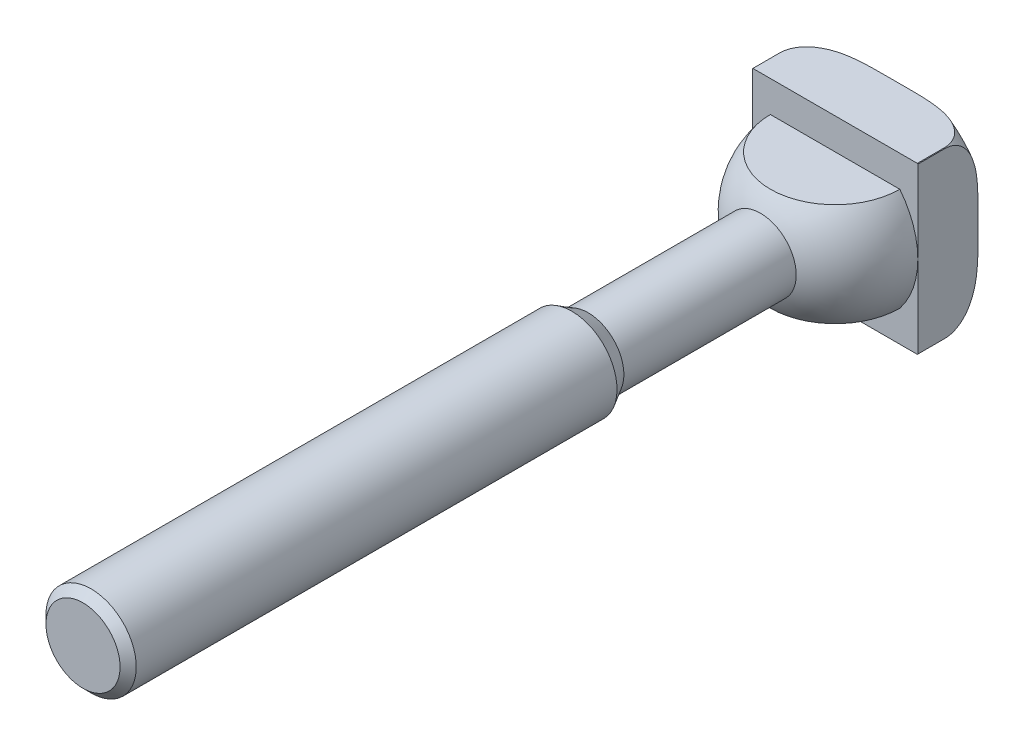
ISO-10303-21;
HEADER;
FILE_DESCRIPTION(('STEP AP214'),'2;1');
FILE_NAME('part.step','',(''),(''),'','','');
FILE_SCHEMA(('AUTOMOTIVE_DESIGN { 1 0 10303 214 1 1 1 1 }'));
ENDSEC;
DATA;
#1=APPLICATION_CONTEXT('core data for automotive mechanical design processes');
#2=APPLICATION_PROTOCOL_DEFINITION('international standard','automotive_design',2000,#1);
#3=PRODUCT_CONTEXT('',#1,'mechanical');
#4=PRODUCT('Part','Part','',(#3));
#5=PRODUCT_RELATED_PRODUCT_CATEGORY('part','',(#4));
#6=PRODUCT_DEFINITION_FORMATION('','',#4);
#7=PRODUCT_DEFINITION_CONTEXT('part definition',#1,'design');
#8=PRODUCT_DEFINITION('design','',#6,#7);
#9=PRODUCT_DEFINITION_SHAPE('','',#8);
#10=(LENGTH_UNIT() NAMED_UNIT(*) SI_UNIT(.MILLI.,.METRE.));
#11=(NAMED_UNIT(*) PLANE_ANGLE_UNIT() SI_UNIT($,.RADIAN.));
#12=(NAMED_UNIT(*) SI_UNIT($,.STERADIAN.) SOLID_ANGLE_UNIT());
#13=UNCERTAINTY_MEASURE_WITH_UNIT(LENGTH_MEASURE(1.E-05),#10,'distance_accuracy_value','');
#14=(GEOMETRIC_REPRESENTATION_CONTEXT(3) GLOBAL_UNCERTAINTY_ASSIGNED_CONTEXT((#13)) GLOBAL_UNIT_ASSIGNED_CONTEXT((#10,
#11,#12)) REPRESENTATION_CONTEXT('',''));
#15=CARTESIAN_POINT('',(0.,0.,0.));
#16=DIRECTION('',(0.,0.,1.));
#17=DIRECTION('',(1.,0.,0.));
#18=AXIS2_PLACEMENT_3D('',#15,#16,#17);
#19=CARTESIAN_POINT('',(0.,0.,-3.6000000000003));
#20=DIRECTION('',(0.,0.,-1.));
#21=DIRECTION('',(0.,1.,0.));
#22=AXIS2_PLACEMENT_3D('',#19,#20,#21);
#23=TOROIDAL_SURFACE('',#22,11.1100000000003,4.39999999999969);
#24=CARTESIAN_POINT('',(11.,0.,-7.99862478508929));
#25=CARTESIAN_POINT('',(11.,0.244167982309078,-7.99862566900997));
#26=CARTESIAN_POINT('',(11.,0.488335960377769,-7.99885116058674));
#27=CARTESIAN_POINT('',(11.,0.976671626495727,-7.99948190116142));
#28=CARTESIAN_POINT('',(11.,1.22083931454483,-7.99988715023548));
#29=CARTESIAN_POINT('',(11.,1.70936602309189,-8.00007526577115));
#30=CARTESIAN_POINT('',(11.,1.95372504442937,-7.99985764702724));
#31=CARTESIAN_POINT('',(11.,2.44244295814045,-7.9975171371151));
#32=CARTESIAN_POINT('',(11.,2.68680185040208,-7.99539420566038));
#33=CARTESIAN_POINT('',(11.,3.17540494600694,-7.98754889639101));
#34=CARTESIAN_POINT('',(11.,3.41964916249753,-7.98182749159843));
#35=CARTESIAN_POINT('',(11.,3.90794771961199,-7.96474581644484));
#36=CARTESIAN_POINT('',(11.,4.15200206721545,-7.95338576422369));
#37=CARTESIAN_POINT('',(11.,4.63930745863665,-7.92271306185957));
#38=CARTESIAN_POINT('',(11.,4.88255914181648,-7.90341115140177));
#39=CARTESIAN_POINT('',(11.,5.36808047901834,-7.85426911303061));
#40=CARTESIAN_POINT('',(11.,5.61034994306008,-7.82442703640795));
#41=CARTESIAN_POINT('',(11.,6.09743926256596,-7.75070651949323));
#42=CARTESIAN_POINT('',(11.,6.3422221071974,-7.70657606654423));
#43=CARTESIAN_POINT('',(11.,6.8280390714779,-7.60128676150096));
#44=CARTESIAN_POINT('',(11.,7.06907525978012,-7.54013768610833));
#45=CARTESIAN_POINT('',(11.,7.5440287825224,-7.39777029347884));
#46=CARTESIAN_POINT('',(11.,7.77797424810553,-7.31664763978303));
#47=CARTESIAN_POINT('',(11.,8.23621103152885,-7.13090753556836));
#48=CARTESIAN_POINT('',(11.,8.460513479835,-7.0263180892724));
#49=CARTESIAN_POINT('',(11.,8.8893021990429,-6.79347114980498));
#50=CARTESIAN_POINT('',(11.,9.09414705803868,-6.66588219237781));
#51=CARTESIAN_POINT('',(11.,9.48435680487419,-6.38282448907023));
#52=CARTESIAN_POINT('',(11.,9.66970590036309,-6.22733341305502));
#53=CARTESIAN_POINT('',(11.,9.92764272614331,-5.97197598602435));
#54=CARTESIAN_POINT('',(11.,10.0107063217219,-5.88257142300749));
#55=CARTESIAN_POINT('',(11.,10.1684678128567,-5.69669341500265));
#56=CARTESIAN_POINT('',(11.,10.2431702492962,-5.60022385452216));
#57=CARTESIAN_POINT('',(11.,10.3828802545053,-5.40067661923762));
#58=CARTESIAN_POINT('',(11.,10.4479014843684,-5.29760855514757));
#59=CARTESIAN_POINT('',(11.,10.5670841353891,-5.08542919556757));
#60=CARTESIAN_POINT('',(11.,10.6212496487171,-4.9763201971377));
#61=CARTESIAN_POINT('',(11.,10.7405401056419,-4.69947224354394));
#62=CARTESIAN_POINT('',(11.,10.7985709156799,-4.52858953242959));
#63=CARTESIAN_POINT('',(11.,10.8850617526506,-4.17956065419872));
#64=CARTESIAN_POINT('',(11.,10.9135367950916,-4.00141822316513));
#65=CARTESIAN_POINT('',(11.,10.9392736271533,-3.64253555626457));
#66=CARTESIAN_POINT('',(11.,10.9364796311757,-3.46179125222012));
#67=CARTESIAN_POINT('',(11.,10.8997077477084,-3.10351565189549));
#68=CARTESIAN_POINT('',(11.,10.8657258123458,-2.92598477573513));
#69=CARTESIAN_POINT('',(11.,10.7697974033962,-2.58326250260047));
#70=CARTESIAN_POINT('',(11.,10.7085296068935,-2.41787879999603));
#71=CARTESIAN_POINT('',(11.,10.5614224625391,-2.09852829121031));
#72=CARTESIAN_POINT('',(11.,10.4755802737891,-1.94456280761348));
#73=CARTESIAN_POINT('',(11.,10.2740206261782,-1.63654089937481));
#74=CARTESIAN_POINT('',(11.,10.1562554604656,-1.48383203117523));
#75=CARTESIAN_POINT('',(11.,9.90072963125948,-1.19621722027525));
#76=CARTESIAN_POINT('',(11.,9.76295152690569,-1.06132700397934));
#77=CARTESIAN_POINT('',(11.,9.38652000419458,-0.735758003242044));
#78=CARTESIAN_POINT('',(11.,9.13606286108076,-0.558702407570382));
#79=CARTESIAN_POINT('',(11.,8.61050942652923,-0.246656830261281));
#80=CARTESIAN_POINT('',(11.,8.33537675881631,-0.111730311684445));
#81=CARTESIAN_POINT('',(11.,7.82006748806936,0.101266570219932));
#82=CARTESIAN_POINT('',(11.,7.58222898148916,0.185159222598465));
#83=CARTESIAN_POINT('',(11.,7.10003595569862,0.331865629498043));
#84=CARTESIAN_POINT('',(11.,6.85567647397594,0.394662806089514));
#85=CARTESIAN_POINT('',(11.,6.36219645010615,0.502824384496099));
#86=CARTESIAN_POINT('',(11.,6.11306070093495,0.548117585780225));
#87=CARTESIAN_POINT('',(11.,5.61276963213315,0.624275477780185));
#88=CARTESIAN_POINT('',(11.,5.36161522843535,0.655146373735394));
#89=CARTESIAN_POINT('',(11.,4.78187506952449,0.713294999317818));
#90=CARTESIAN_POINT('',(11.,4.45290899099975,0.736642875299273));
#91=CARTESIAN_POINT('',(11.,3.79428225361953,0.770498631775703));
#92=CARTESIAN_POINT('',(11.,3.46462137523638,0.781001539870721));
#93=CARTESIAN_POINT('',(11.,2.8047529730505,0.794523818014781));
#94=CARTESIAN_POINT('',(11.,2.47454529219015,0.797533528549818));
#95=CARTESIAN_POINT('',(11.,1.81418154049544,0.800324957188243));
#96=CARTESIAN_POINT('',(11.,1.48402546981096,0.800107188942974));
#97=CARTESIAN_POINT('',(11.,0.82393451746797,0.799332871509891));
#98=CARTESIAN_POINT('',(11.,0.493999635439,0.798776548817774));
#99=CARTESIAN_POINT('',(11.,-0.165885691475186,0.798533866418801));
#100=CARTESIAN_POINT('',(11.,-0.495836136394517,0.798847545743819));
#101=CARTESIAN_POINT('',(11.,-1.15553605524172,0.799731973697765));
#102=CARTESIAN_POINT('',(11.,-1.48528553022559,0.800302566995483));
#103=CARTESIAN_POINT('',(11.,-2.1447765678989,0.799356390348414));
#104=CARTESIAN_POINT('',(11.,-2.47451813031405,0.797839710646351));
#105=CARTESIAN_POINT('',(11.,-3.04438053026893,0.790080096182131));
#106=CARTESIAN_POINT('',(11.,-3.28451680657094,0.785232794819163));
#107=CARTESIAN_POINT('',(11.,-3.76466882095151,0.7704802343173));
#108=CARTESIAN_POINT('',(11.,-4.00468454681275,0.760574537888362));
#109=CARTESIAN_POINT('',(11.,-4.48464487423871,0.733525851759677));
#110=CARTESIAN_POINT('',(11.,-4.72458897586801,0.716373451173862));
#111=CARTESIAN_POINT('',(11.,-5.20361397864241,0.672406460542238));
#112=CARTESIAN_POINT('',(11.,-5.44269491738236,0.645592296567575));
#113=CARTESIAN_POINT('',(11.,-5.92237388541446,0.579216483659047));
#114=CARTESIAN_POINT('',(11.,-6.16294979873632,0.53949003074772));
#115=CARTESIAN_POINT('',(11.,-6.6411374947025,0.444417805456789));
#116=CARTESIAN_POINT('',(11.,-6.87874845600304,0.389067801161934));
#117=CARTESIAN_POINT('',(11.,-7.34813652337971,0.259819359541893));
#118=CARTESIAN_POINT('',(11.,-7.57993016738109,0.185982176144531));
#119=CARTESIAN_POINT('',(11.,-8.0353842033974,0.0165125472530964));
#120=CARTESIAN_POINT('',(11.,-8.25904986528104,-0.0791054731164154));
#121=CARTESIAN_POINT('',(11.,-8.70040739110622,-0.298322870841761));
#122=CARTESIAN_POINT('',(11.,-8.91774655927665,-0.422642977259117));
#123=CARTESIAN_POINT('',(11.,-9.33339082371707,-0.700649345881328));
#124=CARTESIAN_POINT('',(11.,-9.53169018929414,-0.854344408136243));
#125=CARTESIAN_POINT('',(11.,-9.80930539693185,-1.10870064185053));
#126=CARTESIAN_POINT('',(11.,-9.89904640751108,-1.19810417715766));
#127=CARTESIAN_POINT('',(11.,-10.0700814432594,-1.38462017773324));
#128=CARTESIAN_POINT('',(11.,-10.1513803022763,-1.4817281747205));
#129=CARTESIAN_POINT('',(11.,-10.3040772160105,-1.68326064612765));
#130=CARTESIAN_POINT('',(11.,-10.3754890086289,-1.7876746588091));
#131=CARTESIAN_POINT('',(11.,-10.5070935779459,-2.00328733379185));
#132=CARTESIAN_POINT('',(11.,-10.5672911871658,-2.11448304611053));
#133=CARTESIAN_POINT('',(11.,-10.6985537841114,-2.39251409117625));
#134=CARTESIAN_POINT('',(11.,-10.76299986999,-2.5625558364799));
#135=CARTESIAN_POINT('',(11.,-10.862440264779,-2.91098018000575));
#136=CARTESIAN_POINT('',(11.,-10.8974518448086,-3.08935782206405));
#137=CARTESIAN_POINT('',(11.,-10.9360122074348,-3.44995476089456));
#138=CARTESIAN_POINT('',(11.,-10.9394870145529,-3.63218208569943));
#139=CARTESIAN_POINT('',(11.,-10.9145419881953,-3.99443117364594));
#140=CARTESIAN_POINT('',(11.,-10.8861197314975,-4.17445276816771));
#141=CARTESIAN_POINT('',(11.,-10.8006529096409,-4.52098257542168));
#142=CARTESIAN_POINT('',(11.,-10.7446134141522,-4.68774209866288));
#143=CARTESIAN_POINT('',(11.,-10.6074145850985,-5.01050120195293));
#144=CARTESIAN_POINT('',(11.,-10.5262513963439,-5.16649912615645));
#145=CARTESIAN_POINT('',(11.,-10.3348573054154,-5.47752748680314));
#146=CARTESIAN_POINT('',(11.,-10.2227798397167,-5.63141482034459));
#147=CARTESIAN_POINT('',(11.,-9.97826988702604,-5.92196783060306));
#148=CARTESIAN_POINT('',(11.,-9.84582459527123,-6.05862257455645));
#149=CARTESIAN_POINT('',(11.,-9.48633467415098,-6.38591323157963));
#150=CARTESIAN_POINT('',(11.,-9.2478216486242,-6.56397460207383));
#151=CARTESIAN_POINT('',(11.,-8.74555737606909,-6.87988293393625));
#152=CARTESIAN_POINT('',(11.,-8.48175205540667,-7.01764106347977));
#153=CARTESIAN_POINT('',(11.,-7.9912674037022,-7.23459728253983));
#154=CARTESIAN_POINT('',(11.,-7.76724215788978,-7.31996551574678));
#155=CARTESIAN_POINT('',(11.,-7.31248611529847,-7.47076953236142));
#156=CARTESIAN_POINT('',(11.,-7.08175056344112,-7.53619078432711));
#157=CARTESIAN_POINT('',(11.,-6.61580785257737,-7.65016374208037));
#158=CARTESIAN_POINT('',(11.,-6.38059348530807,-7.69868530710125));
#159=CARTESIAN_POINT('',(11.,-5.90765678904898,-7.78166493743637));
#160=CARTESIAN_POINT('',(11.,-5.66993347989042,-7.81611728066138));
#161=CARTESIAN_POINT('',(11.,-5.20678918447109,-7.87205097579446));
#162=CARTESIAN_POINT('',(11.,-4.98144154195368,-7.89416108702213));
#163=CARTESIAN_POINT('',(11.,-4.53016547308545,-7.93045973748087));
#164=CARTESIAN_POINT('',(11.,-4.30423713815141,-7.94464945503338));
#165=CARTESIAN_POINT('',(11.,-3.85190033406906,-7.96709033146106));
#166=CARTESIAN_POINT('',(11.,-3.62549161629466,-7.97533617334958));
#167=CARTESIAN_POINT('',(11.,-3.17256308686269,-7.98764124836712));
#168=CARTESIAN_POINT('',(11.,-2.94604327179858,-7.9917003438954));
#169=CARTESIAN_POINT('',(11.,-2.49282649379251,-7.99717570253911));
#170=CARTESIAN_POINT('',(11.,-2.26612951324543,-7.9985902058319));
#171=CARTESIAN_POINT('',(11.,-1.81273701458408,-8.00004599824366));
#172=CARTESIAN_POINT('',(11.,-1.58604149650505,-8.00008730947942));
#173=CARTESIAN_POINT('',(11.,-1.13278850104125,-7.99975527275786));
#174=CARTESIAN_POINT('',(11.,-0.906231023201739,-7.9993821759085));
#175=CARTESIAN_POINT('',(11.,-0.453115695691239,-7.9988165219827));
#176=CARTESIAN_POINT('',(11.,-0.226557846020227,-7.99862396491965));
#177=CARTESIAN_POINT('',(11.,0.,-7.99862478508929));
#178=B_SPLINE_CURVE_WITH_KNOTS('',3,(#24,#25,#26,#27,#28,#29,#30,#31,#32,#33,#34,#35,#36,#37,
#38,#39,#40,#41,#42,#43,#44,#45,#46,#47,#48,#49,#50,#51,#52,#53,#54,#55,#56,#57,#58,#59,#60,#61,
#62,#63,#64,#65,#66,#67,#68,#69,#70,#71,#72,#73,#74,#75,#76,#77,#78,#79,#80,#81,#82,#83,#84,#85,
#86,#87,#88,#89,#90,#91,#92,#93,#94,#95,#96,#97,#98,#99,#100,#101,#102,#103,#104,#105,#106,#107,
#108,#109,#110,#111,#112,#113,#114,#115,#116,#117,#118,#119,#120,#121,#122,#123,#124,#125,#126,
#127,#128,#129,#130,#131,#132,#133,#134,#135,#136,#137,#138,#139,#140,#141,#142,#143,#144,#145,
#146,#147,#148,#149,#150,#151,#152,#153,#154,#155,#156,#157,#158,#159,#160,#161,#162,#163,#164,
#165,#166,#167,#168,#169,#170,#171,#172,#173,#174,#175,#176,#177),.UNSPECIFIED.,.T.,.F.,(4,2,2,
2,2,2,2,2,2,2,2,2,2,2,2,2,2,2,2,2,2,2,2,2,2,2,2,2,2,2,2,2,2,2,2,2,2,2,2,2,2,2,2,2,2,2,2,2,2,2,2,
2,2,2,2,2,2,2,2,2,2,2,2,2,2,2,2,2,2,2,2,2,2,2,2,2,4),(0.,0.732503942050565,1.46500819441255,
2.19808321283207,2.9311737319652,3.66406610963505,4.39693013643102,5.12880635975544,
5.86081796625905,6.60651638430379,7.35178730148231,8.09355590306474,8.83444397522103,
9.55651629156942,10.2791690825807,10.6448684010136,11.0103681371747,11.3753471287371,
11.7401882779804,12.279036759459,12.8176113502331,13.3571469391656,13.8967525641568,
14.423627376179,14.9505631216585,15.5269516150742,16.1038454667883,17.0187682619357,
17.9350627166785,18.6905663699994,19.446662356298,20.2058023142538,20.9646153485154,
21.9535833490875,22.9429340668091,23.933559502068,24.9240272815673,25.9138331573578,
26.9036834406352,27.8929360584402,28.8821459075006,29.602668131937,30.3232526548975,
31.0447758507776,31.7662672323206,32.4973547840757,33.2286405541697,33.9575346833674,
34.6859474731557,35.4351499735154,36.1845772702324,36.5641726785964,36.9435495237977,
37.3223938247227,37.7010744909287,38.2440729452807,38.7867525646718,39.3307048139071,
39.8746983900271,40.4002130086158,40.9258083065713,41.4947952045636,42.06414128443,
42.9520282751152,43.8418577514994,44.5600475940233,45.2787593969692,45.9987465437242,
46.7190262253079,47.3981425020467,48.0771577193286,48.7567795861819,49.4364237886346,
50.1165200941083,50.7966054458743,51.4762789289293,52.155952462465),.UNSPECIFIED.);
#179=CARTESIAN_POINT('',(11.,1.55951915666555,-8.));
#180=VERTEX_POINT('',#179);
#181=CARTESIAN_POINT('',(11.,10.9343541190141,-3.6));
#182=VERTEX_POINT('',#181);
#183=EDGE_CURVE('E262',#180,#182,#178,.T.);
#184=ORIENTED_EDGE('',*,*,#183,.F.);
#185=CARTESIAN_POINT('',(0.,0.,-8.));
#186=DIRECTION('',(0.,0.,-1.));
#187=DIRECTION('',(0.,1.,0.));
#188=AXIS2_PLACEMENT_3D('',#185,#186,#187);
#189=CIRCLE('',#188,11.11);
#190=CARTESIAN_POINT('',(1.55951915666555,11.,-8.));
#191=VERTEX_POINT('',#190);
#192=EDGE_CURVE('E265',#191,#180,#189,.T.);
#193=ORIENTED_EDGE('',*,*,#192,.F.);
#194=CARTESIAN_POINT('',(0.,11.,-7.99862478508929));
#195=CARTESIAN_POINT('',(-0.244167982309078,11.,-7.99862566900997));
#196=CARTESIAN_POINT('',(-0.488335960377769,11.,-7.99885116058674));
#197=CARTESIAN_POINT('',(-0.976671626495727,11.,-7.99948190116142));
#198=CARTESIAN_POINT('',(-1.22083931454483,11.,-7.99988715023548));
#199=CARTESIAN_POINT('',(-1.70936602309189,11.,-8.00007526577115));
#200=CARTESIAN_POINT('',(-1.95372504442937,11.,-7.99985764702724));
#201=CARTESIAN_POINT('',(-2.44244295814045,11.,-7.9975171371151));
#202=CARTESIAN_POINT('',(-2.68680185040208,11.,-7.99539420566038));
#203=CARTESIAN_POINT('',(-3.17540494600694,11.,-7.98754889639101));
#204=CARTESIAN_POINT('',(-3.41964916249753,11.,-7.98182749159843));
#205=CARTESIAN_POINT('',(-3.90794771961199,11.,-7.96474581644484));
#206=CARTESIAN_POINT('',(-4.15200206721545,11.,-7.95338576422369));
#207=CARTESIAN_POINT('',(-4.63930745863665,11.,-7.92271306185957));
#208=CARTESIAN_POINT('',(-4.88255914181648,11.,-7.90341115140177));
#209=CARTESIAN_POINT('',(-5.36808047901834,11.,-7.85426911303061));
#210=CARTESIAN_POINT('',(-5.61034994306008,11.,-7.82442703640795));
#211=CARTESIAN_POINT('',(-6.09743926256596,11.,-7.75070651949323));
#212=CARTESIAN_POINT('',(-6.3422221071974,11.,-7.70657606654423));
#213=CARTESIAN_POINT('',(-6.8280390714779,11.,-7.60128676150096));
#214=CARTESIAN_POINT('',(-7.06907525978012,11.,-7.54013768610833));
#215=CARTESIAN_POINT('',(-7.5440287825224,11.,-7.39777029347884));
#216=CARTESIAN_POINT('',(-7.77797424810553,11.,-7.31664763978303));
#217=CARTESIAN_POINT('',(-8.23621103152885,11.,-7.13090753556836));
#218=CARTESIAN_POINT('',(-8.460513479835,11.,-7.0263180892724));
#219=CARTESIAN_POINT('',(-8.8893021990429,11.,-6.79347114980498));
#220=CARTESIAN_POINT('',(-9.09414705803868,11.,-6.66588219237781));
#221=CARTESIAN_POINT('',(-9.48435680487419,11.,-6.38282448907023));
#222=CARTESIAN_POINT('',(-9.66970590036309,11.,-6.22733341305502));
#223=CARTESIAN_POINT('',(-9.92764272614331,11.,-5.97197598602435));
#224=CARTESIAN_POINT('',(-10.0107063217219,11.,-5.88257142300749));
#225=CARTESIAN_POINT('',(-10.1684678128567,11.,-5.69669341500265));
#226=CARTESIAN_POINT('',(-10.2431702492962,11.,-5.60022385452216));
#227=CARTESIAN_POINT('',(-10.3828802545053,11.,-5.40067661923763));
#228=CARTESIAN_POINT('',(-10.4479014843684,11.,-5.29760855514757));
#229=CARTESIAN_POINT('',(-10.5670841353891,11.,-5.08542919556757));
#230=CARTESIAN_POINT('',(-10.6212496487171,11.,-4.9763201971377));
#231=CARTESIAN_POINT('',(-10.7405401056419,11.,-4.69947224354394));
#232=CARTESIAN_POINT('',(-10.7985709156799,11.,-4.5285895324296));
#233=CARTESIAN_POINT('',(-10.8850617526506,11.,-4.17956065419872));
#234=CARTESIAN_POINT('',(-10.9135367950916,11.,-4.00141822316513));
#235=CARTESIAN_POINT('',(-10.9392736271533,11.,-3.64253555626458));
#236=CARTESIAN_POINT('',(-10.9364796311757,11.,-3.46179125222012));
#237=CARTESIAN_POINT('',(-10.8997077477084,11.,-3.10351565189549));
#238=CARTESIAN_POINT('',(-10.8657258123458,11.,-2.92598477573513));
#239=CARTESIAN_POINT('',(-10.7697974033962,11.,-2.58326250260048));
#240=CARTESIAN_POINT('',(-10.7085296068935,11.,-2.41787879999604));
#241=CARTESIAN_POINT('',(-10.5614224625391,11.,-2.09852829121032));
#242=CARTESIAN_POINT('',(-10.4755802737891,11.,-1.94456280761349));
#243=CARTESIAN_POINT('',(-10.2740206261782,11.,-1.63654089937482));
#244=CARTESIAN_POINT('',(-10.1562554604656,11.,-1.48383203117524));
#245=CARTESIAN_POINT('',(-9.90072963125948,11.,-1.19621722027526));
#246=CARTESIAN_POINT('',(-9.76295152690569,11.,-1.06132700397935));
#247=CARTESIAN_POINT('',(-9.38652000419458,11.,-0.735758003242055));
#248=CARTESIAN_POINT('',(-9.13606286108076,11.,-0.558702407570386));
#249=CARTESIAN_POINT('',(-8.61050942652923,11.,-0.24665683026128));
#250=CARTESIAN_POINT('',(-8.33537675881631,11.,-0.111730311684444));
#251=CARTESIAN_POINT('',(-7.82006748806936,11.,0.101266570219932));
#252=CARTESIAN_POINT('',(-7.58222898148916,11.,0.185159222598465));
#253=CARTESIAN_POINT('',(-7.10003595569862,11.,0.331865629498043));
#254=CARTESIAN_POINT('',(-6.85567647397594,11.,0.394662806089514));
#255=CARTESIAN_POINT('',(-6.36219645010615,11.,0.5028243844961));
#256=CARTESIAN_POINT('',(-6.11306070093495,11.,0.548117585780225));
#257=CARTESIAN_POINT('',(-5.61276963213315,11.,0.624275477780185));
#258=CARTESIAN_POINT('',(-5.36161522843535,11.,0.655146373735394));
#259=CARTESIAN_POINT('',(-4.78187506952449,11.,0.713294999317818));
#260=CARTESIAN_POINT('',(-4.45290899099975,11.,0.736642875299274));
#261=CARTESIAN_POINT('',(-3.79428225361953,11.,0.770498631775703));
#262=CARTESIAN_POINT('',(-3.46462137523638,11.,0.78100153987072));
#263=CARTESIAN_POINT('',(-2.80475297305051,11.,0.79452381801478));
#264=CARTESIAN_POINT('',(-2.47454529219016,11.,0.797533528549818));
#265=CARTESIAN_POINT('',(-1.81418154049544,11.,0.800324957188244));
#266=CARTESIAN_POINT('',(-1.48402546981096,11.,0.800107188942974));
#267=CARTESIAN_POINT('',(-0.823934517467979,11.,0.799332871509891));
#268=CARTESIAN_POINT('',(-0.49399963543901,11.,0.798776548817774));
#269=CARTESIAN_POINT('',(0.165885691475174,11.,0.7985338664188));
#270=CARTESIAN_POINT('',(0.495836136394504,11.,0.798847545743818));
#271=CARTESIAN_POINT('',(1.1555360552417,11.,0.799731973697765));
#272=CARTESIAN_POINT('',(1.48528553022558,11.,0.800302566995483));
#273=CARTESIAN_POINT('',(2.14477656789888,11.,0.799356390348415));
#274=CARTESIAN_POINT('',(2.47451813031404,11.,0.797839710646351));
#275=CARTESIAN_POINT('',(3.04438053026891,11.,0.790080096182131));
#276=CARTESIAN_POINT('',(3.28451680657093,11.,0.785232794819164));
#277=CARTESIAN_POINT('',(3.7646688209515,11.,0.7704802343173));
#278=CARTESIAN_POINT('',(4.00468454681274,11.,0.760574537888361));
#279=CARTESIAN_POINT('',(4.4846448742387,11.,0.733525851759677));
#280=CARTESIAN_POINT('',(4.72458897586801,11.,0.716373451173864));
#281=CARTESIAN_POINT('',(5.20361397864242,11.,0.672406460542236));
#282=CARTESIAN_POINT('',(5.44269491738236,11.,0.645592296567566));
#283=CARTESIAN_POINT('',(5.92237388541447,11.,0.579216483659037));
#284=CARTESIAN_POINT('',(6.16294979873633,11.,0.539490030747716));
#285=CARTESIAN_POINT('',(6.64113749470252,11.,0.444417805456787));
#286=CARTESIAN_POINT('',(6.87874845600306,11.,0.389067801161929));
#287=CARTESIAN_POINT('',(7.34813652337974,11.,0.259819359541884));
#288=CARTESIAN_POINT('',(7.57993016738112,11.,0.185982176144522));
#289=CARTESIAN_POINT('',(8.03538420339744,11.,0.0165125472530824));
#290=CARTESIAN_POINT('',(8.25904986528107,11.,-0.0791054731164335));
#291=CARTESIAN_POINT('',(8.70040739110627,11.,-0.298322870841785));
#292=CARTESIAN_POINT('',(8.91774655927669,11.,-0.422642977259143));
#293=CARTESIAN_POINT('',(9.3333908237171,11.,-0.700649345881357));
#294=CARTESIAN_POINT('',(9.53169018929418,11.,-0.854344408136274));
#295=CARTESIAN_POINT('',(9.80930539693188,11.,-1.10870064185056));
#296=CARTESIAN_POINT('',(9.89904640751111,11.,-1.19810417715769));
#297=CARTESIAN_POINT('',(10.0700814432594,11.,-1.38462017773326));
#298=CARTESIAN_POINT('',(10.1513803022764,11.,-1.48172817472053));
#299=CARTESIAN_POINT('',(10.3040772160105,11.,-1.68326064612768));
#300=CARTESIAN_POINT('',(10.3754890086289,11.,-1.78767465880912));
#301=CARTESIAN_POINT('',(10.5070935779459,11.,-2.00328733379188));
#302=CARTESIAN_POINT('',(10.5672911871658,11.,-2.11448304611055));
#303=CARTESIAN_POINT('',(10.6985537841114,11.,-2.39251409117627));
#304=CARTESIAN_POINT('',(10.76299986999,11.,-2.56255583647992));
#305=CARTESIAN_POINT('',(10.862440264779,11.,-2.91098018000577));
#306=CARTESIAN_POINT('',(10.8974518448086,11.,-3.08935782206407));
#307=CARTESIAN_POINT('',(10.9360122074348,11.,-3.44995476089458));
#308=CARTESIAN_POINT('',(10.9394870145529,11.,-3.63218208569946));
#309=CARTESIAN_POINT('',(10.9145419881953,11.,-3.99443117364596));
#310=CARTESIAN_POINT('',(10.8861197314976,11.,-4.17445276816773));
#311=CARTESIAN_POINT('',(10.8006529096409,11.,-4.5209825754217));
#312=CARTESIAN_POINT('',(10.7446134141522,11.,-4.6877420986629));
#313=CARTESIAN_POINT('',(10.6074145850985,11.,-5.01050120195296));
#314=CARTESIAN_POINT('',(10.5262513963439,11.,-5.16649912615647));
#315=CARTESIAN_POINT('',(10.3348573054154,11.,-5.47752748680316));
#316=CARTESIAN_POINT('',(10.2227798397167,11.,-5.63141482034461));
#317=CARTESIAN_POINT('',(9.97826988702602,11.,-5.92196783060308));
#318=CARTESIAN_POINT('',(9.84582459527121,11.,-6.05862257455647));
#319=CARTESIAN_POINT('',(9.48633467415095,11.,-6.38591323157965));
#320=CARTESIAN_POINT('',(9.24782164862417,11.,-6.56397460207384));
#321=CARTESIAN_POINT('',(8.74555737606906,11.,-6.87988293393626));
#322=CARTESIAN_POINT('',(8.48175205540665,11.,-7.0176410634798));
#323=CARTESIAN_POINT('',(7.99126740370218,11.,-7.23459728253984));
#324=CARTESIAN_POINT('',(7.76724215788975,11.,-7.31996551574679));
#325=CARTESIAN_POINT('',(7.31248611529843,11.,-7.47076953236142));
#326=CARTESIAN_POINT('',(7.08175056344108,11.,-7.53619078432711));
#327=CARTESIAN_POINT('',(6.61580785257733,11.,-7.65016374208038));
#328=CARTESIAN_POINT('',(6.38059348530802,11.,-7.69868530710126));
#329=CARTESIAN_POINT('',(5.90765678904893,11.,-7.78166493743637));
#330=CARTESIAN_POINT('',(5.66993347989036,11.,-7.81611728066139));
#331=CARTESIAN_POINT('',(5.20678918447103,11.,-7.87205097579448));
#332=CARTESIAN_POINT('',(4.98144154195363,11.,-7.89416108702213));
#333=CARTESIAN_POINT('',(4.5301654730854,11.,-7.93045973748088));
#334=CARTESIAN_POINT('',(4.30423713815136,11.,-7.94464945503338));
#335=CARTESIAN_POINT('',(3.85190033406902,11.,-7.96709033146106));
#336=CARTESIAN_POINT('',(3.62549161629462,11.,-7.97533617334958));
#337=CARTESIAN_POINT('',(3.17256308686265,11.,-7.98764124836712));
#338=CARTESIAN_POINT('',(2.94604327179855,11.,-7.9917003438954));
#339=CARTESIAN_POINT('',(2.49282649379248,11.,-7.99717570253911));
#340=CARTESIAN_POINT('',(2.2661295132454,11.,-7.99859020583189));
#341=CARTESIAN_POINT('',(1.81273701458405,11.,-8.00004599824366));
#342=CARTESIAN_POINT('',(1.58604149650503,11.,-8.00008730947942));
#343=CARTESIAN_POINT('',(1.13278850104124,11.,-7.99975527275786));
#344=CARTESIAN_POINT('',(0.906231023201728,11.,-7.9993821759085));
#345=CARTESIAN_POINT('',(0.453115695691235,11.,-7.9988165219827));
#346=CARTESIAN_POINT('',(0.226557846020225,11.,-7.99862396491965));
#347=CARTESIAN_POINT('',(0.,11.,-7.99862478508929));
#348=B_SPLINE_CURVE_WITH_KNOTS('',3,(#194,#195,#196,#197,#198,#199,#200,#201,#202,#203,#204,
#205,#206,#207,#208,#209,#210,#211,#212,#213,#214,#215,#216,#217,#218,#219,#220,#221,#222,#223,
#224,#225,#226,#227,#228,#229,#230,#231,#232,#233,#234,#235,#236,#237,#238,#239,#240,#241,#242,
#243,#244,#245,#246,#247,#248,#249,#250,#251,#252,#253,#254,#255,#256,#257,#258,#259,#260,#261,
#262,#263,#264,#265,#266,#267,#268,#269,#270,#271,#272,#273,#274,#275,#276,#277,#278,#279,#280,
#281,#282,#283,#284,#285,#286,#287,#288,#289,#290,#291,#292,#293,#294,#295,#296,#297,#298,#299,
#300,#301,#302,#303,#304,#305,#306,#307,#308,#309,#310,#311,#312,#313,#314,#315,#316,#317,#318,
#319,#320,#321,#322,#323,#324,#325,#326,#327,#328,#329,#330,#331,#332,#333,#334,#335,#336,#337,
#338,#339,#340,#341,#342,#343,#344,#345,#346,#347),.UNSPECIFIED.,.T.,.F.,(4,2,2,2,2,2,2,2,2,2,2,
2,2,2,2,2,2,2,2,2,2,2,2,2,2,2,2,2,2,2,2,2,2,2,2,2,2,2,2,2,2,2,2,2,2,2,2,2,2,2,2,2,2,2,2,2,2,2,2,
2,2,2,2,2,2,2,2,2,2,2,2,2,2,2,2,2,4),(0.,0.732503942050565,1.46500819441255,2.19808321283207,
2.9311737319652,3.66406610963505,4.39693013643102,5.12880635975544,5.86081796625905,
6.60651638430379,7.35178730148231,8.09355590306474,8.83444397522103,9.55651629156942,
10.2791690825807,10.6448684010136,11.0103681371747,11.3753471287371,11.7401882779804,
12.279036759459,12.8176113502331,13.3571469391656,13.8967525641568,14.423627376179,
14.9505631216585,15.5269516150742,16.1038454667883,17.0187682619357,17.9350627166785,
18.6905663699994,19.446662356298,20.2058023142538,20.9646153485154,21.9535833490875,
22.9429340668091,23.933559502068,24.9240272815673,25.9138331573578,26.9036834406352,
27.8929360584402,28.8821459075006,29.602668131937,30.3232526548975,31.0447758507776,
31.7662672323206,32.4973547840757,33.2286405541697,33.9575346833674,34.6859474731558,
35.4351499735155,36.1845772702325,36.5641726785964,36.9435495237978,37.3223938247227,
37.7010744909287,38.2440729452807,38.7867525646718,39.3307048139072,39.8746983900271,
40.4002130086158,40.9258083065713,41.4947952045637,42.06414128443,42.9520282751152,
43.8418577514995,44.5600475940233,45.2787593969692,45.9987465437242,46.719026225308,
47.3981425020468,48.0771577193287,48.7567795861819,49.4364237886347,50.1165200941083,
50.7966054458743,51.4762789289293,52.155952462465),.UNSPECIFIED.);
#349=CARTESIAN_POINT('',(10.9343541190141,11.,-3.6));
#350=VERTEX_POINT('',#349);
#351=EDGE_CURVE('E308',#350,#191,#348,.T.);
#352=ORIENTED_EDGE('',*,*,#351,.F.);
#353=CARTESIAN_POINT('',(0.,0.,-3.6));
#354=DIRECTION('',(0.,0.,-1.));
#355=DIRECTION('',(0.,1.,0.));
#356=AXIS2_PLACEMENT_3D('',#353,#354,#355);
#357=CIRCLE('',#356,15.51);
#358=EDGE_CURVE('E167',#350,#182,#357,.T.);
#359=ORIENTED_EDGE('',*,*,#358,.T.);
#360=EDGE_LOOP('',(#184,#193,#352,#359));
#361=FACE_BOUND('',#360,.T.);
#362=ADVANCED_FACE('F14',(#361),#23,.T.);
#363=CARTESIAN_POINT('',(11.,-10.9343541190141,-3.6));
#364=VERTEX_POINT('',#363);
#365=CARTESIAN_POINT('',(11.,-1.55951915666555,-8.));
#366=VERTEX_POINT('',#365);
#367=EDGE_CURVE('E269',#364,#366,#178,.T.);
#368=ORIENTED_EDGE('',*,*,#367,.F.);
#369=CARTESIAN_POINT('',(10.9343541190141,-11.,-3.6));
#370=VERTEX_POINT('',#369);
#371=EDGE_CURVE('E288',#364,#370,#357,.T.);
#372=ORIENTED_EDGE('',*,*,#371,.T.);
#373=CARTESIAN_POINT('',(0.,-11.,-7.99862478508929));
#374=CARTESIAN_POINT('',(0.244167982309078,-11.,-7.99862566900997));
#375=CARTESIAN_POINT('',(0.488335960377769,-11.,-7.99885116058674));
#376=CARTESIAN_POINT('',(0.976671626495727,-11.,-7.99948190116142));
#377=CARTESIAN_POINT('',(1.22083931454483,-11.,-7.99988715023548));
#378=CARTESIAN_POINT('',(1.70936602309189,-11.,-8.00007526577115));
#379=CARTESIAN_POINT('',(1.95372504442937,-11.,-7.99985764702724));
#380=CARTESIAN_POINT('',(2.44244295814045,-11.,-7.9975171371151));
#381=CARTESIAN_POINT('',(2.68680185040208,-11.,-7.99539420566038));
#382=CARTESIAN_POINT('',(3.17540494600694,-11.,-7.98754889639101));
#383=CARTESIAN_POINT('',(3.41964916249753,-11.,-7.98182749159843));
#384=CARTESIAN_POINT('',(3.90794771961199,-11.,-7.96474581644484));
#385=CARTESIAN_POINT('',(4.15200206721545,-11.,-7.95338576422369));
#386=CARTESIAN_POINT('',(4.63930745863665,-11.,-7.92271306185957));
#387=CARTESIAN_POINT('',(4.88255914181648,-11.,-7.90341115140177));
#388=CARTESIAN_POINT('',(5.36808047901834,-11.,-7.85426911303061));
#389=CARTESIAN_POINT('',(5.61034994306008,-11.,-7.82442703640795));
#390=CARTESIAN_POINT('',(6.09743926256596,-11.,-7.75070651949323));
#391=CARTESIAN_POINT('',(6.3422221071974,-11.,-7.70657606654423));
#392=CARTESIAN_POINT('',(6.8280390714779,-11.,-7.60128676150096));
#393=CARTESIAN_POINT('',(7.06907525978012,-11.,-7.54013768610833));
#394=CARTESIAN_POINT('',(7.5440287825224,-11.,-7.39777029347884));
#395=CARTESIAN_POINT('',(7.77797424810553,-11.,-7.31664763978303));
#396=CARTESIAN_POINT('',(8.23621103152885,-11.,-7.13090753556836));
#397=CARTESIAN_POINT('',(8.460513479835,-11.,-7.0263180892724));
#398=CARTESIAN_POINT('',(8.8893021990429,-11.,-6.79347114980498));
#399=CARTESIAN_POINT('',(9.09414705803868,-11.,-6.66588219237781));
#400=CARTESIAN_POINT('',(9.48435680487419,-11.,-6.38282448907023));
#401=CARTESIAN_POINT('',(9.66970590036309,-11.,-6.22733341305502));
#402=CARTESIAN_POINT('',(9.92764272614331,-11.,-5.97197598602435));
#403=CARTESIAN_POINT('',(10.0107063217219,-11.,-5.88257142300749));
#404=CARTESIAN_POINT('',(10.1684678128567,-11.,-5.69669341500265));
#405=CARTESIAN_POINT('',(10.2431702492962,-11.,-5.60022385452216));
#406=CARTESIAN_POINT('',(10.3828802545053,-11.,-5.40067661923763));
#407=CARTESIAN_POINT('',(10.4479014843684,-11.,-5.29760855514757));
#408=CARTESIAN_POINT('',(10.5670841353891,-11.,-5.08542919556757));
#409=CARTESIAN_POINT('',(10.6212496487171,-11.,-4.9763201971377));
#410=CARTESIAN_POINT('',(10.7405401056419,-11.,-4.69947224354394));
#411=CARTESIAN_POINT('',(10.7985709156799,-11.,-4.5285895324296));
#412=CARTESIAN_POINT('',(10.8850617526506,-11.,-4.17956065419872));
#413=CARTESIAN_POINT('',(10.9135367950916,-11.,-4.00141822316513));
#414=CARTESIAN_POINT('',(10.9392736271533,-11.,-3.64253555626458));
#415=CARTESIAN_POINT('',(10.9364796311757,-11.,-3.46179125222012));
#416=CARTESIAN_POINT('',(10.8997077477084,-11.,-3.10351565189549));
#417=CARTESIAN_POINT('',(10.8657258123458,-11.,-2.92598477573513));
#418=CARTESIAN_POINT('',(10.7697974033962,-11.,-2.58326250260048));
#419=CARTESIAN_POINT('',(10.7085296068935,-11.,-2.41787879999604));
#420=CARTESIAN_POINT('',(10.5614224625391,-11.,-2.09852829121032));
#421=CARTESIAN_POINT('',(10.4755802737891,-11.,-1.94456280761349));
#422=CARTESIAN_POINT('',(10.2740206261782,-11.,-1.63654089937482));
#423=CARTESIAN_POINT('',(10.1562554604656,-11.,-1.48383203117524));
#424=CARTESIAN_POINT('',(9.90072963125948,-11.,-1.19621722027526));
#425=CARTESIAN_POINT('',(9.76295152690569,-11.,-1.06132700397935));
#426=CARTESIAN_POINT('',(9.38652000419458,-11.,-0.735758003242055));
#427=CARTESIAN_POINT('',(9.13606286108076,-11.,-0.558702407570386));
#428=CARTESIAN_POINT('',(8.61050942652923,-11.,-0.24665683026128));
#429=CARTESIAN_POINT('',(8.33537675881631,-11.,-0.111730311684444));
#430=CARTESIAN_POINT('',(7.82006748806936,-11.,0.101266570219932));
#431=CARTESIAN_POINT('',(7.58222898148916,-11.,0.185159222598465));
#432=CARTESIAN_POINT('',(7.10003595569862,-11.,0.331865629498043));
#433=CARTESIAN_POINT('',(6.85567647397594,-11.,0.394662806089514));
#434=CARTESIAN_POINT('',(6.36219645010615,-11.,0.5028243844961));
#435=CARTESIAN_POINT('',(6.11306070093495,-11.,0.548117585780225));
#436=CARTESIAN_POINT('',(5.61276963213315,-11.,0.624275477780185));
#437=CARTESIAN_POINT('',(5.36161522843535,-11.,0.655146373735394));
#438=CARTESIAN_POINT('',(4.78187506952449,-11.,0.713294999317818));
#439=CARTESIAN_POINT('',(4.45290899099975,-11.,0.736642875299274));
#440=CARTESIAN_POINT('',(3.79428225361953,-11.,0.770498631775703));
#441=CARTESIAN_POINT('',(3.46462137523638,-11.,0.78100153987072));
#442=CARTESIAN_POINT('',(2.80475297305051,-11.,0.79452381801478));
#443=CARTESIAN_POINT('',(2.47454529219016,-11.,0.797533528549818));
#444=CARTESIAN_POINT('',(1.81418154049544,-11.,0.800324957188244));
#445=CARTESIAN_POINT('',(1.48402546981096,-11.,0.800107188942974));
#446=CARTESIAN_POINT('',(0.823934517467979,-11.,0.799332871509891));
#447=CARTESIAN_POINT('',(0.49399963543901,-11.,0.798776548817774));
#448=CARTESIAN_POINT('',(-0.165885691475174,-11.,0.7985338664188));
#449=CARTESIAN_POINT('',(-0.495836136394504,-11.,0.798847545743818));
#450=CARTESIAN_POINT('',(-1.1555360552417,-11.,0.799731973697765));
#451=CARTESIAN_POINT('',(-1.48528553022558,-11.,0.800302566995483));
#452=CARTESIAN_POINT('',(-2.14477656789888,-11.,0.799356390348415));
#453=CARTESIAN_POINT('',(-2.47451813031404,-11.,0.797839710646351));
#454=CARTESIAN_POINT('',(-3.04438053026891,-11.,0.790080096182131));
#455=CARTESIAN_POINT('',(-3.28451680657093,-11.,0.785232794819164));
#456=CARTESIAN_POINT('',(-3.7646688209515,-11.,0.7704802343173));
#457=CARTESIAN_POINT('',(-4.00468454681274,-11.,0.760574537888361));
#458=CARTESIAN_POINT('',(-4.4846448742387,-11.,0.733525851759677));
#459=CARTESIAN_POINT('',(-4.72458897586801,-11.,0.716373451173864));
#460=CARTESIAN_POINT('',(-5.20361397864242,-11.,0.672406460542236));
#461=CARTESIAN_POINT('',(-5.44269491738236,-11.,0.645592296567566));
#462=CARTESIAN_POINT('',(-5.92237388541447,-11.,0.579216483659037));
#463=CARTESIAN_POINT('',(-6.16294979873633,-11.,0.539490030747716));
#464=CARTESIAN_POINT('',(-6.64113749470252,-11.,0.444417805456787));
#465=CARTESIAN_POINT('',(-6.87874845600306,-11.,0.389067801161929));
#466=CARTESIAN_POINT('',(-7.34813652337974,-11.,0.259819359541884));
#467=CARTESIAN_POINT('',(-7.57993016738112,-11.,0.185982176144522));
#468=CARTESIAN_POINT('',(-8.03538420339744,-11.,0.0165125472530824));
#469=CARTESIAN_POINT('',(-8.25904986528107,-11.,-0.0791054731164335));
#470=CARTESIAN_POINT('',(-8.70040739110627,-11.,-0.298322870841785));
#471=CARTESIAN_POINT('',(-8.91774655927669,-11.,-0.422642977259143));
#472=CARTESIAN_POINT('',(-9.3333908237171,-11.,-0.700649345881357));
#473=CARTESIAN_POINT('',(-9.53169018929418,-11.,-0.854344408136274));
#474=CARTESIAN_POINT('',(-9.80930539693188,-11.,-1.10870064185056));
#475=CARTESIAN_POINT('',(-9.89904640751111,-11.,-1.19810417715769));
#476=CARTESIAN_POINT('',(-10.0700814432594,-11.,-1.38462017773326));
#477=CARTESIAN_POINT('',(-10.1513803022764,-11.,-1.48172817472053));
#478=CARTESIAN_POINT('',(-10.3040772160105,-11.,-1.68326064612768));
#479=CARTESIAN_POINT('',(-10.3754890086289,-11.,-1.78767465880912));
#480=CARTESIAN_POINT('',(-10.5070935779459,-11.,-2.00328733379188));
#481=CARTESIAN_POINT('',(-10.5672911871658,-11.,-2.11448304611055));
#482=CARTESIAN_POINT('',(-10.6985537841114,-11.,-2.39251409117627));
#483=CARTESIAN_POINT('',(-10.76299986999,-11.,-2.56255583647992));
#484=CARTESIAN_POINT('',(-10.862440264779,-11.,-2.91098018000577));
#485=CARTESIAN_POINT('',(-10.8974518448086,-11.,-3.08935782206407));
#486=CARTESIAN_POINT('',(-10.9360122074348,-11.,-3.44995476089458));
#487=CARTESIAN_POINT('',(-10.9394870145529,-11.,-3.63218208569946));
#488=CARTESIAN_POINT('',(-10.9145419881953,-11.,-3.99443117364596));
#489=CARTESIAN_POINT('',(-10.8861197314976,-11.,-4.17445276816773));
#490=CARTESIAN_POINT('',(-10.8006529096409,-11.,-4.5209825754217));
#491=CARTESIAN_POINT('',(-10.7446134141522,-11.,-4.6877420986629));
#492=CARTESIAN_POINT('',(-10.6074145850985,-11.,-5.01050120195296));
#493=CARTESIAN_POINT('',(-10.5262513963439,-11.,-5.16649912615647));
#494=CARTESIAN_POINT('',(-10.3348573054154,-11.,-5.47752748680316));
#495=CARTESIAN_POINT('',(-10.2227798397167,-11.,-5.63141482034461));
#496=CARTESIAN_POINT('',(-9.97826988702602,-11.,-5.92196783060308));
#497=CARTESIAN_POINT('',(-9.84582459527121,-11.,-6.05862257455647));
#498=CARTESIAN_POINT('',(-9.48633467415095,-11.,-6.38591323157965));
#499=CARTESIAN_POINT('',(-9.24782164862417,-11.,-6.56397460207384));
#500=CARTESIAN_POINT('',(-8.74555737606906,-11.,-6.87988293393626));
#501=CARTESIAN_POINT('',(-8.48175205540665,-11.,-7.0176410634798));
#502=CARTESIAN_POINT('',(-7.99126740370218,-11.,-7.23459728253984));
#503=CARTESIAN_POINT('',(-7.76724215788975,-11.,-7.31996551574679));
#504=CARTESIAN_POINT('',(-7.31248611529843,-11.,-7.47076953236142));
#505=CARTESIAN_POINT('',(-7.08175056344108,-11.,-7.53619078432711));
#506=CARTESIAN_POINT('',(-6.61580785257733,-11.,-7.65016374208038));
#507=CARTESIAN_POINT('',(-6.38059348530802,-11.,-7.69868530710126));
#508=CARTESIAN_POINT('',(-5.90765678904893,-11.,-7.78166493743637));
#509=CARTESIAN_POINT('',(-5.66993347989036,-11.,-7.81611728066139));
#510=CARTESIAN_POINT('',(-5.20678918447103,-11.,-7.87205097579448));
#511=CARTESIAN_POINT('',(-4.98144154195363,-11.,-7.89416108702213));
#512=CARTESIAN_POINT('',(-4.5301654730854,-11.,-7.93045973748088));
#513=CARTESIAN_POINT('',(-4.30423713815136,-11.,-7.94464945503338));
#514=CARTESIAN_POINT('',(-3.85190033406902,-11.,-7.96709033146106));
#515=CARTESIAN_POINT('',(-3.62549161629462,-11.,-7.97533617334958));
#516=CARTESIAN_POINT('',(-3.17256308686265,-11.,-7.98764124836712));
#517=CARTESIAN_POINT('',(-2.94604327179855,-11.,-7.9917003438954));
#518=CARTESIAN_POINT('',(-2.49282649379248,-11.,-7.99717570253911));
#519=CARTESIAN_POINT('',(-2.2661295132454,-11.,-7.99859020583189));
#520=CARTESIAN_POINT('',(-1.81273701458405,-11.,-8.00004599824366));
#521=CARTESIAN_POINT('',(-1.58604149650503,-11.,-8.00008730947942));
#522=CARTESIAN_POINT('',(-1.13278850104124,-11.,-7.99975527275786));
#523=CARTESIAN_POINT('',(-0.906231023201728,-11.,-7.9993821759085));
#524=CARTESIAN_POINT('',(-0.453115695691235,-11.,-7.9988165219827));
#525=CARTESIAN_POINT('',(-0.226557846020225,-11.,-7.99862396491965));
#526=CARTESIAN_POINT('',(0.,-11.,-7.99862478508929));
#527=B_SPLINE_CURVE_WITH_KNOTS('',3,(#373,#374,#375,#376,#377,#378,#379,#380,#381,#382,#383,
#384,#385,#386,#387,#388,#389,#390,#391,#392,#393,#394,#395,#396,#397,#398,#399,#400,#401,#402,
#403,#404,#405,#406,#407,#408,#409,#410,#411,#412,#413,#414,#415,#416,#417,#418,#419,#420,#421,
#422,#423,#424,#425,#426,#427,#428,#429,#430,#431,#432,#433,#434,#435,#436,#437,#438,#439,#440,
#441,#442,#443,#444,#445,#446,#447,#448,#449,#450,#451,#452,#453,#454,#455,#456,#457,#458,#459,
#460,#461,#462,#463,#464,#465,#466,#467,#468,#469,#470,#471,#472,#473,#474,#475,#476,#477,#478,
#479,#480,#481,#482,#483,#484,#485,#486,#487,#488,#489,#490,#491,#492,#493,#494,#495,#496,#497,
#498,#499,#500,#501,#502,#503,#504,#505,#506,#507,#508,#509,#510,#511,#512,#513,#514,#515,#516,
#517,#518,#519,#520,#521,#522,#523,#524,#525,#526),.UNSPECIFIED.,.T.,.F.,(4,2,2,2,2,2,2,2,2,2,2,
2,2,2,2,2,2,2,2,2,2,2,2,2,2,2,2,2,2,2,2,2,2,2,2,2,2,2,2,2,2,2,2,2,2,2,2,2,2,2,2,2,2,2,2,2,2,2,2,
2,2,2,2,2,2,2,2,2,2,2,2,2,2,2,2,2,4),(0.,0.732503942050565,1.46500819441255,2.19808321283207,
2.9311737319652,3.66406610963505,4.39693013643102,5.12880635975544,5.86081796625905,
6.60651638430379,7.35178730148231,8.09355590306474,8.83444397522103,9.55651629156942,
10.2791690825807,10.6448684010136,11.0103681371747,11.3753471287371,11.7401882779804,
12.279036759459,12.8176113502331,13.3571469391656,13.8967525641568,14.423627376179,
14.9505631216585,15.5269516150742,16.1038454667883,17.0187682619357,17.9350627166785,
18.6905663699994,19.446662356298,20.2058023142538,20.9646153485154,21.9535833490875,
22.9429340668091,23.933559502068,24.9240272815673,25.9138331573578,26.9036834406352,
27.8929360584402,28.8821459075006,29.602668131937,30.3232526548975,31.0447758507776,
31.7662672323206,32.4973547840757,33.2286405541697,33.9575346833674,34.6859474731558,
35.4351499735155,36.1845772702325,36.5641726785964,36.9435495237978,37.3223938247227,
37.7010744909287,38.2440729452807,38.7867525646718,39.3307048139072,39.8746983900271,
40.4002130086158,40.9258083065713,41.4947952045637,42.06414128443,42.9520282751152,
43.8418577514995,44.5600475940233,45.2787593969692,45.9987465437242,46.719026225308,
47.3981425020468,48.0771577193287,48.7567795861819,49.4364237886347,50.1165200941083,
50.7966054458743,51.4762789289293,52.155952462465),.UNSPECIFIED.);
#528=CARTESIAN_POINT('',(1.55951915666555,-11.,-8.));
#529=VERTEX_POINT('',#528);
#530=EDGE_CURVE('E190',#529,#370,#527,.T.);
#531=ORIENTED_EDGE('',*,*,#530,.F.);
#532=EDGE_CURVE('E280',#366,#529,#189,.T.);
#533=ORIENTED_EDGE('',*,*,#532,.F.);
#534=EDGE_LOOP('',(#368,#372,#531,#533));
#535=FACE_BOUND('',#534,.T.);
#536=ADVANCED_FACE('F253',(#535),#23,.T.);
#537=CARTESIAN_POINT('',(-10.9343541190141,-11.,-3.6));
#538=VERTEX_POINT('',#537);
#539=CARTESIAN_POINT('',(-1.55951915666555,-11.,-8.));
#540=VERTEX_POINT('',#539);
#541=EDGE_CURVE('E191',#538,#540,#527,.T.);
#542=ORIENTED_EDGE('',*,*,#541,.F.);
#543=CARTESIAN_POINT('',(-11.,-10.9343541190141,-3.6));
#544=VERTEX_POINT('',#543);
#545=EDGE_CURVE('E166',#538,#544,#357,.T.);
#546=ORIENTED_EDGE('',*,*,#545,.T.);
#547=CARTESIAN_POINT('',(-11.,0.,-7.99862478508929));
#548=CARTESIAN_POINT('',(-11.,-0.244167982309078,-7.99862566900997));
#549=CARTESIAN_POINT('',(-11.,-0.488335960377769,-7.99885116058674));
#550=CARTESIAN_POINT('',(-11.,-0.976671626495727,-7.99948190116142));
#551=CARTESIAN_POINT('',(-11.,-1.22083931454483,-7.99988715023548));
#552=CARTESIAN_POINT('',(-11.,-1.70936602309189,-8.00007526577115));
#553=CARTESIAN_POINT('',(-11.,-1.95372504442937,-7.99985764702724));
#554=CARTESIAN_POINT('',(-11.,-2.44244295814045,-7.9975171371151));
#555=CARTESIAN_POINT('',(-11.,-2.68680185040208,-7.99539420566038));
#556=CARTESIAN_POINT('',(-11.,-3.17540494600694,-7.98754889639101));
#557=CARTESIAN_POINT('',(-11.,-3.41964916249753,-7.98182749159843));
#558=CARTESIAN_POINT('',(-11.,-3.90794771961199,-7.96474581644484));
#559=CARTESIAN_POINT('',(-11.,-4.15200206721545,-7.95338576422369));
#560=CARTESIAN_POINT('',(-11.,-4.63930745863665,-7.92271306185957));
#561=CARTESIAN_POINT('',(-11.,-4.88255914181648,-7.90341115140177));
#562=CARTESIAN_POINT('',(-11.,-5.36808047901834,-7.85426911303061));
#563=CARTESIAN_POINT('',(-11.,-5.61034994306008,-7.82442703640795));
#564=CARTESIAN_POINT('',(-11.,-6.09743926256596,-7.75070651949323));
#565=CARTESIAN_POINT('',(-11.,-6.3422221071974,-7.70657606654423));
#566=CARTESIAN_POINT('',(-11.,-6.8280390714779,-7.60128676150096));
#567=CARTESIAN_POINT('',(-11.,-7.06907525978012,-7.54013768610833));
#568=CARTESIAN_POINT('',(-11.,-7.5440287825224,-7.39777029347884));
#569=CARTESIAN_POINT('',(-11.,-7.77797424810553,-7.31664763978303));
#570=CARTESIAN_POINT('',(-11.,-8.23621103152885,-7.13090753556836));
#571=CARTESIAN_POINT('',(-11.,-8.460513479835,-7.0263180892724));
#572=CARTESIAN_POINT('',(-11.,-8.8893021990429,-6.79347114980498));
#573=CARTESIAN_POINT('',(-11.,-9.09414705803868,-6.66588219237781));
#574=CARTESIAN_POINT('',(-11.,-9.48435680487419,-6.38282448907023));
#575=CARTESIAN_POINT('',(-11.,-9.66970590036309,-6.22733341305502));
#576=CARTESIAN_POINT('',(-11.,-9.92764272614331,-5.97197598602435));
#577=CARTESIAN_POINT('',(-11.,-10.0107063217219,-5.88257142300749));
#578=CARTESIAN_POINT('',(-11.,-10.1684678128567,-5.69669341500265));
#579=CARTESIAN_POINT('',(-11.,-10.2431702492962,-5.60022385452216));
#580=CARTESIAN_POINT('',(-11.,-10.3828802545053,-5.40067661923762));
#581=CARTESIAN_POINT('',(-11.,-10.4479014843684,-5.29760855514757));
#582=CARTESIAN_POINT('',(-11.,-10.5670841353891,-5.08542919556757));
#583=CARTESIAN_POINT('',(-11.,-10.6212496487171,-4.9763201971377));
#584=CARTESIAN_POINT('',(-11.,-10.7405401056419,-4.69947224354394));
#585=CARTESIAN_POINT('',(-11.,-10.7985709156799,-4.52858953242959));
#586=CARTESIAN_POINT('',(-11.,-10.8850617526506,-4.17956065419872));
#587=CARTESIAN_POINT('',(-11.,-10.9135367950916,-4.00141822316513));
#588=CARTESIAN_POINT('',(-11.,-10.9392736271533,-3.64253555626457));
#589=CARTESIAN_POINT('',(-11.,-10.9364796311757,-3.46179125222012));
#590=CARTESIAN_POINT('',(-11.,-10.8997077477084,-3.10351565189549));
#591=CARTESIAN_POINT('',(-11.,-10.8657258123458,-2.92598477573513));
#592=CARTESIAN_POINT('',(-11.,-10.7697974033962,-2.58326250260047));
#593=CARTESIAN_POINT('',(-11.,-10.7085296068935,-2.41787879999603));
#594=CARTESIAN_POINT('',(-11.,-10.5614224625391,-2.09852829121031));
#595=CARTESIAN_POINT('',(-11.,-10.4755802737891,-1.94456280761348));
#596=CARTESIAN_POINT('',(-11.,-10.2740206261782,-1.63654089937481));
#597=CARTESIAN_POINT('',(-11.,-10.1562554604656,-1.48383203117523));
#598=CARTESIAN_POINT('',(-11.,-9.90072963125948,-1.19621722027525));
#599=CARTESIAN_POINT('',(-11.,-9.76295152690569,-1.06132700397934));
#600=CARTESIAN_POINT('',(-11.,-9.38652000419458,-0.735758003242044));
#601=CARTESIAN_POINT('',(-11.,-9.13606286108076,-0.558702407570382));
#602=CARTESIAN_POINT('',(-11.,-8.61050942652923,-0.246656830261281));
#603=CARTESIAN_POINT('',(-11.,-8.33537675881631,-0.111730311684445));
#604=CARTESIAN_POINT('',(-11.,-7.82006748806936,0.101266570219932));
#605=CARTESIAN_POINT('',(-11.,-7.58222898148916,0.185159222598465));
#606=CARTESIAN_POINT('',(-11.,-7.10003595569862,0.331865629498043));
#607=CARTESIAN_POINT('',(-11.,-6.85567647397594,0.394662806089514));
#608=CARTESIAN_POINT('',(-11.,-6.36219645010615,0.502824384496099));
#609=CARTESIAN_POINT('',(-11.,-6.11306070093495,0.548117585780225));
#610=CARTESIAN_POINT('',(-11.,-5.61276963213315,0.624275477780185));
#611=CARTESIAN_POINT('',(-11.,-5.36161522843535,0.655146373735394));
#612=CARTESIAN_POINT('',(-11.,-4.78187506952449,0.713294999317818));
#613=CARTESIAN_POINT('',(-11.,-4.45290899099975,0.736642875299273));
#614=CARTESIAN_POINT('',(-11.,-3.79428225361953,0.770498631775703));
#615=CARTESIAN_POINT('',(-11.,-3.46462137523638,0.781001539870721));
#616=CARTESIAN_POINT('',(-11.,-2.8047529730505,0.794523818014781));
#617=CARTESIAN_POINT('',(-11.,-2.47454529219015,0.797533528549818));
#618=CARTESIAN_POINT('',(-11.,-1.81418154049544,0.800324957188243));
#619=CARTESIAN_POINT('',(-11.,-1.48402546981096,0.800107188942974));
#620=CARTESIAN_POINT('',(-11.,-0.82393451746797,0.799332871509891));
#621=CARTESIAN_POINT('',(-11.,-0.493999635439,0.798776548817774));
#622=CARTESIAN_POINT('',(-11.,0.165885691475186,0.798533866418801));
#623=CARTESIAN_POINT('',(-11.,0.495836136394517,0.798847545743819));
#624=CARTESIAN_POINT('',(-11.,1.15553605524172,0.799731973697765));
#625=CARTESIAN_POINT('',(-11.,1.48528553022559,0.800302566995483));
#626=CARTESIAN_POINT('',(-11.,2.1447765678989,0.799356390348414));
#627=CARTESIAN_POINT('',(-11.,2.47451813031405,0.797839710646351));
#628=CARTESIAN_POINT('',(-11.,3.04438053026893,0.790080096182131));
#629=CARTESIAN_POINT('',(-11.,3.28451680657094,0.785232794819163));
#630=CARTESIAN_POINT('',(-11.,3.76466882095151,0.7704802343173));
#631=CARTESIAN_POINT('',(-11.,4.00468454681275,0.760574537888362));
#632=CARTESIAN_POINT('',(-11.,4.48464487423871,0.733525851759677));
#633=CARTESIAN_POINT('',(-11.,4.72458897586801,0.716373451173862));
#634=CARTESIAN_POINT('',(-11.,5.20361397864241,0.672406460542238));
#635=CARTESIAN_POINT('',(-11.,5.44269491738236,0.645592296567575));
#636=CARTESIAN_POINT('',(-11.,5.92237388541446,0.579216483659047));
#637=CARTESIAN_POINT('',(-11.,6.16294979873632,0.53949003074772));
#638=CARTESIAN_POINT('',(-11.,6.6411374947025,0.444417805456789));
#639=CARTESIAN_POINT('',(-11.,6.87874845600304,0.389067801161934));
#640=CARTESIAN_POINT('',(-11.,7.34813652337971,0.259819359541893));
#641=CARTESIAN_POINT('',(-11.,7.57993016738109,0.185982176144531));
#642=CARTESIAN_POINT('',(-11.,8.0353842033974,0.0165125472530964));
#643=CARTESIAN_POINT('',(-11.,8.25904986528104,-0.0791054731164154));
#644=CARTESIAN_POINT('',(-11.,8.70040739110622,-0.298322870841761));
#645=CARTESIAN_POINT('',(-11.,8.91774655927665,-0.422642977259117));
#646=CARTESIAN_POINT('',(-11.,9.33339082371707,-0.700649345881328));
#647=CARTESIAN_POINT('',(-11.,9.53169018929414,-0.854344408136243));
#648=CARTESIAN_POINT('',(-11.,9.80930539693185,-1.10870064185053));
#649=CARTESIAN_POINT('',(-11.,9.89904640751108,-1.19810417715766));
#650=CARTESIAN_POINT('',(-11.,10.0700814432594,-1.38462017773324));
#651=CARTESIAN_POINT('',(-11.,10.1513803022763,-1.4817281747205));
#652=CARTESIAN_POINT('',(-11.,10.3040772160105,-1.68326064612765));
#653=CARTESIAN_POINT('',(-11.,10.3754890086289,-1.7876746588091));
#654=CARTESIAN_POINT('',(-11.,10.5070935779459,-2.00328733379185));
#655=CARTESIAN_POINT('',(-11.,10.5672911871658,-2.11448304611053));
#656=CARTESIAN_POINT('',(-11.,10.6985537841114,-2.39251409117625));
#657=CARTESIAN_POINT('',(-11.,10.76299986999,-2.5625558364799));
#658=CARTESIAN_POINT('',(-11.,10.862440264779,-2.91098018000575));
#659=CARTESIAN_POINT('',(-11.,10.8974518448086,-3.08935782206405));
#660=CARTESIAN_POINT('',(-11.,10.9360122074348,-3.44995476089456));
#661=CARTESIAN_POINT('',(-11.,10.9394870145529,-3.63218208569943));
#662=CARTESIAN_POINT('',(-11.,10.9145419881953,-3.99443117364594));
#663=CARTESIAN_POINT('',(-11.,10.8861197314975,-4.17445276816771));
#664=CARTESIAN_POINT('',(-11.,10.8006529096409,-4.52098257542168));
#665=CARTESIAN_POINT('',(-11.,10.7446134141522,-4.68774209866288));
#666=CARTESIAN_POINT('',(-11.,10.6074145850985,-5.01050120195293));
#667=CARTESIAN_POINT('',(-11.,10.5262513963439,-5.16649912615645));
#668=CARTESIAN_POINT('',(-11.,10.3348573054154,-5.47752748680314));
#669=CARTESIAN_POINT('',(-11.,10.2227798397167,-5.63141482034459));
#670=CARTESIAN_POINT('',(-11.,9.97826988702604,-5.92196783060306));
#671=CARTESIAN_POINT('',(-11.,9.84582459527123,-6.05862257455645));
#672=CARTESIAN_POINT('',(-11.,9.48633467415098,-6.38591323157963));
#673=CARTESIAN_POINT('',(-11.,9.2478216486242,-6.56397460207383));
#674=CARTESIAN_POINT('',(-11.,8.74555737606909,-6.87988293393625));
#675=CARTESIAN_POINT('',(-11.,8.48175205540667,-7.01764106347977));
#676=CARTESIAN_POINT('',(-11.,7.9912674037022,-7.23459728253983));
#677=CARTESIAN_POINT('',(-11.,7.76724215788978,-7.31996551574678));
#678=CARTESIAN_POINT('',(-11.,7.31248611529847,-7.47076953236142));
#679=CARTESIAN_POINT('',(-11.,7.08175056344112,-7.53619078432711));
#680=CARTESIAN_POINT('',(-11.,6.61580785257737,-7.65016374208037));
#681=CARTESIAN_POINT('',(-11.,6.38059348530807,-7.69868530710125));
#682=CARTESIAN_POINT('',(-11.,5.90765678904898,-7.78166493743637));
#683=CARTESIAN_POINT('',(-11.,5.66993347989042,-7.81611728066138));
#684=CARTESIAN_POINT('',(-11.,5.20678918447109,-7.87205097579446));
#685=CARTESIAN_POINT('',(-11.,4.98144154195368,-7.89416108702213));
#686=CARTESIAN_POINT('',(-11.,4.53016547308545,-7.93045973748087));
#687=CARTESIAN_POINT('',(-11.,4.30423713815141,-7.94464945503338));
#688=CARTESIAN_POINT('',(-11.,3.85190033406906,-7.96709033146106));
#689=CARTESIAN_POINT('',(-11.,3.62549161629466,-7.97533617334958));
#690=CARTESIAN_POINT('',(-11.,3.17256308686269,-7.98764124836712));
#691=CARTESIAN_POINT('',(-11.,2.94604327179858,-7.9917003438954));
#692=CARTESIAN_POINT('',(-11.,2.49282649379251,-7.99717570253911));
#693=CARTESIAN_POINT('',(-11.,2.26612951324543,-7.9985902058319));
#694=CARTESIAN_POINT('',(-11.,1.81273701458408,-8.00004599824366));
#695=CARTESIAN_POINT('',(-11.,1.58604149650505,-8.00008730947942));
#696=CARTESIAN_POINT('',(-11.,1.13278850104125,-7.99975527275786));
#697=CARTESIAN_POINT('',(-11.,0.906231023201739,-7.9993821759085));
#698=CARTESIAN_POINT('',(-11.,0.453115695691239,-7.9988165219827));
#699=CARTESIAN_POINT('',(-11.,0.226557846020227,-7.99862396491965));
#700=CARTESIAN_POINT('',(-11.,0.,-7.99862478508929));
#701=B_SPLINE_CURVE_WITH_KNOTS('',3,(#547,#548,#549,#550,#551,#552,#553,#554,#555,#556,#557,
#558,#559,#560,#561,#562,#563,#564,#565,#566,#567,#568,#569,#570,#571,#572,#573,#574,#575,#576,
#577,#578,#579,#580,#581,#582,#583,#584,#585,#586,#587,#588,#589,#590,#591,#592,#593,#594,#595,
#596,#597,#598,#599,#600,#601,#602,#603,#604,#605,#606,#607,#608,#609,#610,#611,#612,#613,#614,
#615,#616,#617,#618,#619,#620,#621,#622,#623,#624,#625,#626,#627,#628,#629,#630,#631,#632,#633,
#634,#635,#636,#637,#638,#639,#640,#641,#642,#643,#644,#645,#646,#647,#648,#649,#650,#651,#652,
#653,#654,#655,#656,#657,#658,#659,#660,#661,#662,#663,#664,#665,#666,#667,#668,#669,#670,#671,
#672,#673,#674,#675,#676,#677,#678,#679,#680,#681,#682,#683,#684,#685,#686,#687,#688,#689,#690,
#691,#692,#693,#694,#695,#696,#697,#698,#699,#700),.UNSPECIFIED.,.T.,.F.,(4,2,2,2,2,2,2,2,2,2,2,
2,2,2,2,2,2,2,2,2,2,2,2,2,2,2,2,2,2,2,2,2,2,2,2,2,2,2,2,2,2,2,2,2,2,2,2,2,2,2,2,2,2,2,2,2,2,2,2,
2,2,2,2,2,2,2,2,2,2,2,2,2,2,2,2,2,4),(0.,0.732503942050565,1.46500819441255,2.19808321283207,
2.9311737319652,3.66406610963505,4.39693013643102,5.12880635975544,5.86081796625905,
6.60651638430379,7.35178730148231,8.09355590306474,8.83444397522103,9.55651629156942,
10.2791690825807,10.6448684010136,11.0103681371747,11.3753471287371,11.7401882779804,
12.279036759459,12.8176113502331,13.3571469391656,13.8967525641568,14.423627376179,
14.9505631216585,15.5269516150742,16.1038454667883,17.0187682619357,17.9350627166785,
18.6905663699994,19.446662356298,20.2058023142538,20.9646153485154,21.9535833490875,
22.9429340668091,23.933559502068,24.9240272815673,25.9138331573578,26.9036834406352,
27.8929360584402,28.8821459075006,29.602668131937,30.3232526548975,31.0447758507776,
31.7662672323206,32.4973547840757,33.2286405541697,33.9575346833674,34.6859474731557,
35.4351499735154,36.1845772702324,36.5641726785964,36.9435495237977,37.3223938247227,
37.7010744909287,38.2440729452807,38.7867525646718,39.3307048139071,39.8746983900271,
40.4002130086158,40.9258083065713,41.4947952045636,42.06414128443,42.9520282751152,
43.8418577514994,44.5600475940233,45.2787593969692,45.9987465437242,46.7190262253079,
47.3981425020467,48.0771577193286,48.7567795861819,49.4364237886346,50.1165200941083,
50.7966054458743,51.4762789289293,52.155952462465),.UNSPECIFIED.);
#702=CARTESIAN_POINT('',(-11.,-1.55951915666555,-8.));
#703=VERTEX_POINT('',#702);
#704=EDGE_CURVE('E195',#703,#544,#701,.T.);
#705=ORIENTED_EDGE('',*,*,#704,.F.);
#706=EDGE_CURVE('E284',#540,#703,#189,.T.);
#707=ORIENTED_EDGE('',*,*,#706,.F.);
#708=EDGE_LOOP('',(#542,#546,#705,#707));
#709=FACE_BOUND('',#708,.T.);
#710=ADVANCED_FACE('F248',(#709),#23,.T.);
#711=CARTESIAN_POINT('',(0.,0.,100.));
#712=DIRECTION('',(0.,0.,-1.));
#713=DIRECTION('',(0.,1.,0.));
#714=AXIS2_PLACEMENT_3D('',#711,#712,#713);
#715=CYLINDRICAL_SURFACE('',#714,15.51);
#716=DIRECTION('',(0.,0.,-1.));
#717=VECTOR('',#716,1.);
#718=CARTESIAN_POINT('',(11.,10.9343541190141,100.));
#719=LINE('',#718,#717);
#720=CARTESIAN_POINT('',(11.,10.9343541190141,0.));
#721=VERTEX_POINT('',#720);
#722=EDGE_CURVE('E328',#182,#721,#719,.F.);
#723=ORIENTED_EDGE('',*,*,#722,.F.);
#724=ORIENTED_EDGE('',*,*,#358,.F.);
#725=DIRECTION('',(0.,0.,-1.));
#726=VECTOR('',#725,1.);
#727=CARTESIAN_POINT('',(10.9343541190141,11.,100.));
#728=LINE('',#727,#726);
#729=CARTESIAN_POINT('',(10.9343541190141,11.,0.));
#730=VERTEX_POINT('',#729);
#731=EDGE_CURVE('E360',#730,#350,#728,.T.);
#732=ORIENTED_EDGE('',*,*,#731,.F.);
#733=CARTESIAN_POINT('',(0.,0.,0.));
#734=DIRECTION('',(0.,0.,-1.));
#735=DIRECTION('',(0.,1.,0.));
#736=AXIS2_PLACEMENT_3D('',#733,#734,#735);
#737=CIRCLE('',#736,15.51);
#738=EDGE_CURVE('E152',#730,#721,#737,.T.);
#739=ORIENTED_EDGE('',*,*,#738,.T.);
#740=EDGE_LOOP('',(#723,#724,#732,#739));
#741=FACE_BOUND('',#740,.T.);
#742=ADVANCED_FACE('F241',(#741),#715,.T.);
#743=DIRECTION('',(0.,0.,-1.));
#744=VECTOR('',#743,1.);
#745=CARTESIAN_POINT('',(11.,-10.9343541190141,100.));
#746=LINE('',#745,#744);
#747=CARTESIAN_POINT('',(11.,-10.9343541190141,0.));
#748=VERTEX_POINT('',#747);
#749=EDGE_CURVE('E178',#748,#364,#746,.T.);
#750=ORIENTED_EDGE('',*,*,#749,.F.);
#751=CARTESIAN_POINT('',(10.9343541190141,-11.,0.));
#752=VERTEX_POINT('',#751);
#753=EDGE_CURVE('E157',#748,#752,#737,.T.);
#754=ORIENTED_EDGE('',*,*,#753,.T.);
#755=DIRECTION('',(0.,0.,-1.));
#756=VECTOR('',#755,1.);
#757=CARTESIAN_POINT('',(10.9343541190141,-11.,100.));
#758=LINE('',#757,#756);
#759=EDGE_CURVE('E176',#370,#752,#758,.F.);
#760=ORIENTED_EDGE('',*,*,#759,.F.);
#761=ORIENTED_EDGE('',*,*,#371,.F.);
#762=EDGE_LOOP('',(#750,#754,#760,#761));
#763=FACE_BOUND('',#762,.T.);
#764=ADVANCED_FACE('F173',(#763),#715,.T.);
#765=DIRECTION('',(0.,0.,-1.));
#766=VECTOR('',#765,1.);
#767=CARTESIAN_POINT('',(-10.9343541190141,-11.,100.));
#768=LINE('',#767,#766);
#769=CARTESIAN_POINT('',(-10.9343541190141,-11.,0.));
#770=VERTEX_POINT('',#769);
#771=EDGE_CURVE('E192',#770,#538,#768,.T.);
#772=ORIENTED_EDGE('',*,*,#771,.F.);
#773=CARTESIAN_POINT('',(-11.,-10.9343541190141,0.));
#774=VERTEX_POINT('',#773);
#775=EDGE_CURVE('E151',#770,#774,#737,.T.);
#776=ORIENTED_EDGE('',*,*,#775,.T.);
#777=DIRECTION('',(0.,0.,-1.));
#778=VECTOR('',#777,1.);
#779=CARTESIAN_POINT('',(-11.,-10.9343541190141,100.));
#780=LINE('',#779,#778);
#781=EDGE_CURVE('E297',#544,#774,#780,.F.);
#782=ORIENTED_EDGE('',*,*,#781,.F.);
#783=ORIENTED_EDGE('',*,*,#545,.F.);
#784=EDGE_LOOP('',(#772,#776,#782,#783));
#785=FACE_BOUND('',#784,.T.);
#786=ADVANCED_FACE('F242',(#785),#715,.T.);
#787=CARTESIAN_POINT('',(15.51,0.,0.));
#788=DIRECTION('',(0.,0.,1.));
#789=DIRECTION('',(0.,-1.,0.));
#790=AXIS2_PLACEMENT_3D('',#787,#788,#789);
#791=PLANE('',#790);
#792=CARTESIAN_POINT('',(0.,0.,0.));
#793=DIRECTION('',(0.,0.,-1.));
#794=DIRECTION('',(0.,1.,0.));
#795=AXIS2_PLACEMENT_3D('',#792,#793,#794);
#796=CIRCLE('',#795,11.);
#797=CARTESIAN_POINT('',(-8.6068286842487,-6.84999999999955,0.));
#798=VERTEX_POINT('',#797);
#799=CARTESIAN_POINT('',(-11.,0.,0.));
#800=VERTEX_POINT('',#799);
#801=EDGE_CURVE('E139',#798,#800,#796,.T.);
#802=ORIENTED_EDGE('',*,*,#801,.T.);
#803=DIRECTION('',(0.,1.,0.));
#804=VECTOR('',#803,1.);
#805=CARTESIAN_POINT('',(-11.,0.,0.));
#806=LINE('',#805,#804);
#807=EDGE_CURVE('E186',#774,#800,#806,.T.);
#808=ORIENTED_EDGE('',*,*,#807,.F.);
#809=ORIENTED_EDGE('',*,*,#775,.F.);
#810=DIRECTION('',(-1.,0.,0.));
#811=VECTOR('',#810,1.);
#812=CARTESIAN_POINT('',(15.51,-11.,0.));
#813=LINE('',#812,#811);
#814=EDGE_CURVE('E182',#752,#770,#813,.T.);
#815=ORIENTED_EDGE('',*,*,#814,.F.);
#816=ORIENTED_EDGE('',*,*,#753,.F.);
#817=DIRECTION('',(0.,-1.,0.));
#818=VECTOR('',#817,1.);
#819=CARTESIAN_POINT('',(11.,0.,0.));
#820=LINE('',#819,#818);
#821=CARTESIAN_POINT('',(11.,0.,0.));
#822=VERTEX_POINT('',#821);
#823=EDGE_CURVE('E180',#822,#748,#820,.T.);
#824=ORIENTED_EDGE('',*,*,#823,.F.);
#825=CARTESIAN_POINT('',(8.60682868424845,-6.85,0.));
#826=VERTEX_POINT('',#825);
#827=EDGE_CURVE('E142',#822,#826,#796,.T.);
#828=ORIENTED_EDGE('',*,*,#827,.T.);
#829=DIRECTION('',(-1.,0.,0.));
#830=VECTOR('',#829,1.);
#831=CARTESIAN_POINT('',(11.,-6.85,0.));
#832=LINE('',#831,#830);
#833=EDGE_CURVE('E29',#826,#798,#832,.T.);
#834=ORIENTED_EDGE('',*,*,#833,.T.);
#835=EDGE_LOOP('',(#802,#808,#809,#815,#816,#824,#828,#834));
#836=FACE_BOUND('',#835,.T.);
#837=ADVANCED_FACE('F179',(#836),#791,.T.);
#838=CARTESIAN_POINT('',(0.,0.,-8.));
#839=DIRECTION('',(0.,0.,-1.));
#840=DIRECTION('',(0.,1.,0.));
#841=AXIS2_PLACEMENT_3D('',#838,#839,#840);
#842=PLANE('',#841);
#843=DIRECTION('',(0.,1.,0.));
#844=VECTOR('',#843,1.);
#845=CARTESIAN_POINT('',(11.,-11.,-8.));
#846=LINE('',#845,#844);
#847=EDGE_CURVE('E275',#366,#180,#846,.T.);
#848=ORIENTED_EDGE('',*,*,#847,.F.);
#849=ORIENTED_EDGE('',*,*,#532,.T.);
#850=DIRECTION('',(1.,0.,0.));
#851=VECTOR('',#850,1.);
#852=CARTESIAN_POINT('',(-11.,-11.,-8.));
#853=LINE('',#852,#851);
#854=EDGE_CURVE('E123',#540,#529,#853,.T.);
#855=ORIENTED_EDGE('',*,*,#854,.F.);
#856=ORIENTED_EDGE('',*,*,#706,.T.);
#857=DIRECTION('',(0.,-1.,0.));
#858=VECTOR('',#857,1.);
#859=CARTESIAN_POINT('',(-11.,11.,-8.));
#860=LINE('',#859,#858);
#861=CARTESIAN_POINT('',(-11.,1.55951915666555,-8.));
#862=VERTEX_POINT('',#861);
#863=EDGE_CURVE('E349',#862,#703,#860,.T.);
#864=ORIENTED_EDGE('',*,*,#863,.F.);
#865=CARTESIAN_POINT('',(-1.55951915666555,11.,-8.));
#866=VERTEX_POINT('',#865);
#867=EDGE_CURVE('E282',#862,#866,#189,.T.);
#868=ORIENTED_EDGE('',*,*,#867,.T.);
#869=DIRECTION('',(-1.,0.,0.));
#870=VECTOR('',#869,1.);
#871=CARTESIAN_POINT('',(11.,11.,-8.));
#872=LINE('',#871,#870);
#873=EDGE_CURVE('E278',#191,#866,#872,.T.);
#874=ORIENTED_EDGE('',*,*,#873,.F.);
#875=ORIENTED_EDGE('',*,*,#192,.T.);
#876=EDGE_LOOP('',(#848,#849,#855,#856,#864,#868,#874,#875));
#877=FACE_BOUND('',#876,.T.);
#878=ADVANCED_FACE('F16',(#877),#842,.T.);
#879=CARTESIAN_POINT('',(-11.,10.9343541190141,-3.6));
#880=VERTEX_POINT('',#879);
#881=EDGE_CURVE('E299',#880,#862,#701,.T.);
#882=ORIENTED_EDGE('',*,*,#881,.F.);
#883=CARTESIAN_POINT('',(-10.9343541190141,11.,-3.6));
#884=VERTEX_POINT('',#883);
#885=EDGE_CURVE('E160',#880,#884,#357,.T.);
#886=ORIENTED_EDGE('',*,*,#885,.T.);
#887=EDGE_CURVE('E302',#866,#884,#348,.T.);
#888=ORIENTED_EDGE('',*,*,#887,.F.);
#889=ORIENTED_EDGE('',*,*,#867,.F.);
#890=EDGE_LOOP('',(#882,#886,#888,#889));
#891=FACE_BOUND('',#890,.T.);
#892=ADVANCED_FACE('F204',(#891),#23,.T.);
#893=DIRECTION('',(0.,0.,-1.));
#894=VECTOR('',#893,1.);
#895=CARTESIAN_POINT('',(-11.,10.9343541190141,100.));
#896=LINE('',#895,#894);
#897=CARTESIAN_POINT('',(-11.,10.9343541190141,0.));
#898=VERTEX_POINT('',#897);
#899=EDGE_CURVE('E300',#898,#880,#896,.T.);
#900=ORIENTED_EDGE('',*,*,#899,.F.);
#901=CARTESIAN_POINT('',(-10.9343541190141,11.,0.));
#902=VERTEX_POINT('',#901);
#903=EDGE_CURVE('E147',#898,#902,#737,.T.);
#904=ORIENTED_EDGE('',*,*,#903,.T.);
#905=DIRECTION('',(0.,0.,-1.));
#906=VECTOR('',#905,1.);
#907=CARTESIAN_POINT('',(-10.9343541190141,11.,100.));
#908=LINE('',#907,#906);
#909=EDGE_CURVE('E313',#884,#902,#908,.F.);
#910=ORIENTED_EDGE('',*,*,#909,.F.);
#911=ORIENTED_EDGE('',*,*,#885,.F.);
#912=EDGE_LOOP('',(#900,#904,#910,#911));
#913=FACE_BOUND('',#912,.T.);
#914=ADVANCED_FACE('F239',(#913),#715,.T.);
#915=CARTESIAN_POINT('',(-8.60682868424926,6.85,0.));
#916=VERTEX_POINT('',#915);
#917=EDGE_CURVE('E131',#800,#916,#796,.T.);
#918=ORIENTED_EDGE('',*,*,#917,.T.);
#919=DIRECTION('',(1.,0.,0.));
#920=VECTOR('',#919,1.);
#921=CARTESIAN_POINT('',(-11.,6.85,0.));
#922=LINE('',#921,#920);
#923=CARTESIAN_POINT('',(8.60682868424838,6.85,0.));
#924=VERTEX_POINT('',#923);
#925=EDGE_CURVE('E36',#916,#924,#922,.T.);
#926=ORIENTED_EDGE('',*,*,#925,.T.);
#927=EDGE_CURVE('E133',#924,#822,#796,.T.);
#928=ORIENTED_EDGE('',*,*,#927,.T.);
#929=EDGE_CURVE('E134',#721,#822,#820,.T.);
#930=ORIENTED_EDGE('',*,*,#929,.F.);
#931=ORIENTED_EDGE('',*,*,#738,.F.);
#932=DIRECTION('',(1.,0.,0.));
#933=VECTOR('',#932,1.);
#934=CARTESIAN_POINT('',(15.51,11.,0.));
#935=LINE('',#934,#933);
#936=EDGE_CURVE('E279',#902,#730,#935,.T.);
#937=ORIENTED_EDGE('',*,*,#936,.F.);
#938=ORIENTED_EDGE('',*,*,#903,.F.);
#939=EDGE_CURVE('E138',#800,#898,#806,.T.);
#940=ORIENTED_EDGE('',*,*,#939,.F.);
#941=EDGE_LOOP('',(#918,#926,#928,#930,#931,#937,#938,#940));
#942=FACE_BOUND('',#941,.T.);
#943=ADVANCED_FACE('F136',(#942),#791,.T.);
#944=CARTESIAN_POINT('',(-4.01588484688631E-13,0.,-4.70110061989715E-13));
#945=DIRECTION('',(0.,0.,-1.));
#946=DIRECTION('',(1.,0.,0.));
#947=AXIS2_PLACEMENT_3D('',#944,#945,#946);
#948=SPHERICAL_SURFACE('',#947,11.0000000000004);
#949=CARTESIAN_POINT('',(-4.01588484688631E-13,-6.85,-4.70110061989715E-13));
#950=DIRECTION('',(0.,1.,0.));
#951=DIRECTION('',(0.,0.,1.));
#952=AXIS2_PLACEMENT_3D('',#949,#950,#951);
#953=CIRCLE('',#952,8.60682868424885);
#954=EDGE_CURVE('E9',#826,#798,#953,.F.);
#955=ORIENTED_EDGE('',*,*,#954,.F.);
#956=ORIENTED_EDGE('',*,*,#827,.F.);
#957=ORIENTED_EDGE('',*,*,#927,.F.);
#958=CARTESIAN_POINT('',(-4.01588484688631E-13,6.85,-4.70110061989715E-13));
#959=DIRECTION('',(0.,-1.,0.));
#960=DIRECTION('',(0.,0.,-1.));
#961=AXIS2_PLACEMENT_3D('',#958,#959,#960);
#962=CIRCLE('',#961,8.60682868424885);
#963=EDGE_CURVE('E22',#916,#924,#962,.F.);
#964=ORIENTED_EDGE('',*,*,#963,.F.);
#965=ORIENTED_EDGE('',*,*,#917,.F.);
#966=ORIENTED_EDGE('',*,*,#801,.F.);
#967=EDGE_LOOP('',(#955,#956,#957,#964,#965,#966));
#968=FACE_BOUND('',#967,.T.);
#969=CARTESIAN_POINT('',(0.,0.,9.921567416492));
#970=DIRECTION('',(0.,0.,-1.));
#971=DIRECTION('',(0.,1.,0.));
#972=AXIS2_PLACEMENT_3D('',#969,#970,#971);
#973=CIRCLE('',#972,4.75);
#974=CARTESIAN_POINT('',(0.,4.75,9.921567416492));
#975=VERTEX_POINT('',#974);
#976=EDGE_CURVE('E140',#975,#975,#973,.T.);
#977=ORIENTED_EDGE('',*,*,#976,.T.);
#978=EDGE_LOOP('',(#977));
#979=FACE_BOUND('',#978,.T.);
#980=ADVANCED_FACE('F128',(#968,#979),#948,.T.);
#981=CARTESIAN_POINT('',(0.,0.,100.));
#982=DIRECTION('',(0.,0.,-1.));
#983=DIRECTION('',(0.,1.,0.));
#984=AXIS2_PLACEMENT_3D('',#981,#982,#983);
#985=CYLINDRICAL_SURFACE('',#984,4.75);
#986=CARTESIAN_POINT('',(0.,0.,32.834936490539));
#987=DIRECTION('',(0.,0.,-1.));
#988=DIRECTION('',(0.,1.,0.));
#989=AXIS2_PLACEMENT_3D('',#986,#987,#988);
#990=CIRCLE('',#989,4.75);
#991=CARTESIAN_POINT('',(0.,4.75,32.834936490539));
#992=VERTEX_POINT('',#991);
#993=EDGE_CURVE('E144',#992,#992,#990,.T.);
#994=ORIENTED_EDGE('',*,*,#993,.T.);
#995=EDGE_LOOP('',(#994));
#996=FACE_BOUND('',#995,.T.);
#997=ORIENTED_EDGE('',*,*,#976,.F.);
#998=EDGE_LOOP('',(#997));
#999=FACE_BOUND('',#998,.T.);
#1000=ADVANCED_FACE('F231',(#996,#999),#985,.T.);
#1001=CARTESIAN_POINT('',(0.,0.,32.834936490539));
#1002=DIRECTION('',(0.,0.,1.));
#1003=DIRECTION('',(0.,-1.,0.));
#1004=AXIS2_PLACEMENT_3D('',#1001,#1002,#1003);
#1005=CONICAL_SURFACE('',#1004,4.75,0.523598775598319);
#1006=CARTESIAN_POINT('',(0.,0.,35.));
#1007=DIRECTION('',(0.,0.,-1.));
#1008=DIRECTION('',(0.,1.,0.));
#1009=AXIS2_PLACEMENT_3D('',#1006,#1007,#1008);
#1010=CIRCLE('',#1009,6.);
#1011=CARTESIAN_POINT('',(0.,6.,35.));
#1012=VERTEX_POINT('',#1011);
#1013=EDGE_CURVE('E334',#1012,#1012,#1010,.T.);
#1014=ORIENTED_EDGE('',*,*,#1013,.T.);
#1015=EDGE_LOOP('',(#1014));
#1016=FACE_BOUND('',#1015,.T.);
#1017=ORIENTED_EDGE('',*,*,#993,.F.);
#1018=EDGE_LOOP('',(#1017));
#1019=FACE_BOUND('',#1018,.T.);
#1020=ADVANCED_FACE('F227',(#1016,#1019),#1005,.T.);
#1021=CARTESIAN_POINT('',(0.,0.,100.));
#1022=DIRECTION('',(0.,0.,-1.));
#1023=DIRECTION('',(0.,1.,0.));
#1024=AXIS2_PLACEMENT_3D('',#1021,#1022,#1023);
#1025=CYLINDRICAL_SURFACE('',#1024,6.);
#1026=CARTESIAN_POINT('',(0.,0.,98.9265));
#1027=DIRECTION('',(0.,0.,-1.));
#1028=DIRECTION('',(0.,1.,0.));
#1029=AXIS2_PLACEMENT_3D('',#1026,#1027,#1028);
#1030=CIRCLE('',#1029,6.);
#1031=CARTESIAN_POINT('',(0.,6.,98.9265));
#1032=VERTEX_POINT('',#1031);
#1033=EDGE_CURVE('E331',#1032,#1032,#1030,.T.);
#1034=ORIENTED_EDGE('',*,*,#1033,.T.);
#1035=EDGE_LOOP('',(#1034));
#1036=FACE_BOUND('',#1035,.T.);
#1037=ORIENTED_EDGE('',*,*,#1013,.F.);
#1038=EDGE_LOOP('',(#1037));
#1039=FACE_BOUND('',#1038,.T.);
#1040=ADVANCED_FACE('F223',(#1036,#1039),#1025,.T.);
#1041=CARTESIAN_POINT('',(0.,0.,98.9265));
#1042=DIRECTION('',(0.,0.,-1.));
#1043=DIRECTION('',(0.,1.,0.));
#1044=AXIS2_PLACEMENT_3D('',#1041,#1042,#1043);
#1045=CONICAL_SURFACE('',#1044,6.,0.785398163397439);
#1046=CARTESIAN_POINT('',(0.,0.,100.));
#1047=DIRECTION('',(0.,0.,-1.));
#1048=DIRECTION('',(0.,1.,0.));
#1049=AXIS2_PLACEMENT_3D('',#1046,#1047,#1048);
#1050=CIRCLE('',#1049,4.9265);
#1051=CARTESIAN_POINT('',(0.,4.9265,100.));
#1052=VERTEX_POINT('',#1051);
#1053=EDGE_CURVE('E268',#1052,#1052,#1050,.T.);
#1054=ORIENTED_EDGE('',*,*,#1053,.T.);
#1055=EDGE_LOOP('',(#1054));
#1056=FACE_BOUND('',#1055,.T.);
#1057=ORIENTED_EDGE('',*,*,#1033,.F.);
#1058=EDGE_LOOP('',(#1057));
#1059=FACE_BOUND('',#1058,.T.);
#1060=ADVANCED_FACE('F219',(#1056,#1059),#1045,.T.);
#1061=CARTESIAN_POINT('',(4.9265,0.,100.));
#1062=DIRECTION('',(0.,0.,1.));
#1063=DIRECTION('',(0.,-1.,0.));
#1064=AXIS2_PLACEMENT_3D('',#1061,#1062,#1063);
#1065=PLANE('',#1064);
#1066=ORIENTED_EDGE('',*,*,#1053,.F.);
#1067=EDGE_LOOP('',(#1066));
#1068=FACE_BOUND('',#1067,.T.);
#1069=ADVANCED_FACE('F215',(#1068),#1065,.T.);
#1070=CARTESIAN_POINT('',(11.,11.,492.));
#1071=DIRECTION('',(0.,-1.,0.));
#1072=DIRECTION('',(0.,0.,-1.));
#1073=AXIS2_PLACEMENT_3D('',#1070,#1071,#1072);
#1074=PLANE('',#1073);
#1075=ORIENTED_EDGE('',*,*,#887,.T.);
#1076=ORIENTED_EDGE('',*,*,#909,.T.);
#1077=ORIENTED_EDGE('',*,*,#936,.T.);
#1078=ORIENTED_EDGE('',*,*,#731,.T.);
#1079=ORIENTED_EDGE('',*,*,#351,.T.);
#1080=ORIENTED_EDGE('',*,*,#873,.T.);
#1081=EDGE_LOOP('',(#1075,#1076,#1077,#1078,#1079,#1080));
#1082=FACE_BOUND('',#1081,.T.);
#1083=ADVANCED_FACE('F218',(#1082),#1074,.F.);
#1084=CARTESIAN_POINT('',(-11.,11.,492.));
#1085=DIRECTION('',(1.,0.,0.));
#1086=DIRECTION('',(0.,1.,0.));
#1087=AXIS2_PLACEMENT_3D('',#1084,#1085,#1086);
#1088=PLANE('',#1087);
#1089=ORIENTED_EDGE('',*,*,#704,.T.);
#1090=ORIENTED_EDGE('',*,*,#781,.T.);
#1091=ORIENTED_EDGE('',*,*,#807,.T.);
#1092=ORIENTED_EDGE('',*,*,#939,.T.);
#1093=ORIENTED_EDGE('',*,*,#899,.T.);
#1094=ORIENTED_EDGE('',*,*,#881,.T.);
#1095=ORIENTED_EDGE('',*,*,#863,.T.);
#1096=EDGE_LOOP('',(#1089,#1090,#1091,#1092,#1093,#1094,#1095));
#1097=FACE_BOUND('',#1096,.T.);
#1098=ADVANCED_FACE('F212',(#1097),#1088,.F.);
#1099=CARTESIAN_POINT('',(-11.,-11.,492.));
#1100=DIRECTION('',(0.,1.,0.));
#1101=DIRECTION('',(0.,0.,1.));
#1102=AXIS2_PLACEMENT_3D('',#1099,#1100,#1101);
#1103=PLANE('',#1102);
#1104=ORIENTED_EDGE('',*,*,#530,.T.);
#1105=ORIENTED_EDGE('',*,*,#759,.T.);
#1106=ORIENTED_EDGE('',*,*,#814,.T.);
#1107=ORIENTED_EDGE('',*,*,#771,.T.);
#1108=ORIENTED_EDGE('',*,*,#541,.T.);
#1109=ORIENTED_EDGE('',*,*,#854,.T.);
#1110=EDGE_LOOP('',(#1104,#1105,#1106,#1107,#1108,#1109));
#1111=FACE_BOUND('',#1110,.T.);
#1112=ADVANCED_FACE('F188',(#1111),#1103,.F.);
#1113=CARTESIAN_POINT('',(11.,-11.,492.));
#1114=DIRECTION('',(-1.,0.,0.));
#1115=DIRECTION('',(0.,-1.,0.));
#1116=AXIS2_PLACEMENT_3D('',#1113,#1114,#1115);
#1117=PLANE('',#1116);
#1118=ORIENTED_EDGE('',*,*,#183,.T.);
#1119=ORIENTED_EDGE('',*,*,#722,.T.);
#1120=ORIENTED_EDGE('',*,*,#929,.T.);
#1121=ORIENTED_EDGE('',*,*,#823,.T.);
#1122=ORIENTED_EDGE('',*,*,#749,.T.);
#1123=ORIENTED_EDGE('',*,*,#367,.T.);
#1124=ORIENTED_EDGE('',*,*,#847,.T.);
#1125=EDGE_LOOP('',(#1118,#1119,#1120,#1121,#1122,#1123,#1124));
#1126=FACE_BOUND('',#1125,.T.);
#1127=ADVANCED_FACE('F211',(#1126),#1117,.F.);
#1128=CARTESIAN_POINT('',(-11.,6.85,0.));
#1129=DIRECTION('',(0.,-1.,0.));
#1130=DIRECTION('',(0.,0.,-1.));
#1131=AXIS2_PLACEMENT_3D('',#1128,#1129,#1130);
#1132=PLANE('',#1131);
#1133=ORIENTED_EDGE('',*,*,#963,.T.);
#1134=ORIENTED_EDGE('',*,*,#925,.F.);
#1135=EDGE_LOOP('',(#1133,#1134));
#1136=FACE_BOUND('',#1135,.T.);
#1137=ADVANCED_FACE('F121',(#1136),#1132,.F.);
#1138=CARTESIAN_POINT('',(11.,-6.85,0.));
#1139=DIRECTION('',(0.,1.,0.));
#1140=DIRECTION('',(0.,0.,1.));
#1141=AXIS2_PLACEMENT_3D('',#1138,#1139,#1140);
#1142=PLANE('',#1141);
#1143=ORIENTED_EDGE('',*,*,#954,.T.);
#1144=ORIENTED_EDGE('',*,*,#833,.F.);
#1145=EDGE_LOOP('',(#1143,#1144));
#1146=FACE_BOUND('',#1145,.T.);
#1147=ADVANCED_FACE('F322',(#1146),#1142,.F.);
#1148=CLOSED_SHELL('',(#362,#536,#710,#742,#764,#786,#837,#878,#892,#914,#943,#980,#1000,#1020,
#1040,#1060,#1069,#1083,#1098,#1112,#1127,#1137,#1147));
#1149=MANIFOLD_SOLID_BREP('B1',#1148);
#1150=ADVANCED_BREP_SHAPE_REPRESENTATION('',(#18,#1149),#14);
#1151=SHAPE_DEFINITION_REPRESENTATION(#9,#1150);
ENDSEC;
END-ISO-10303-21;
